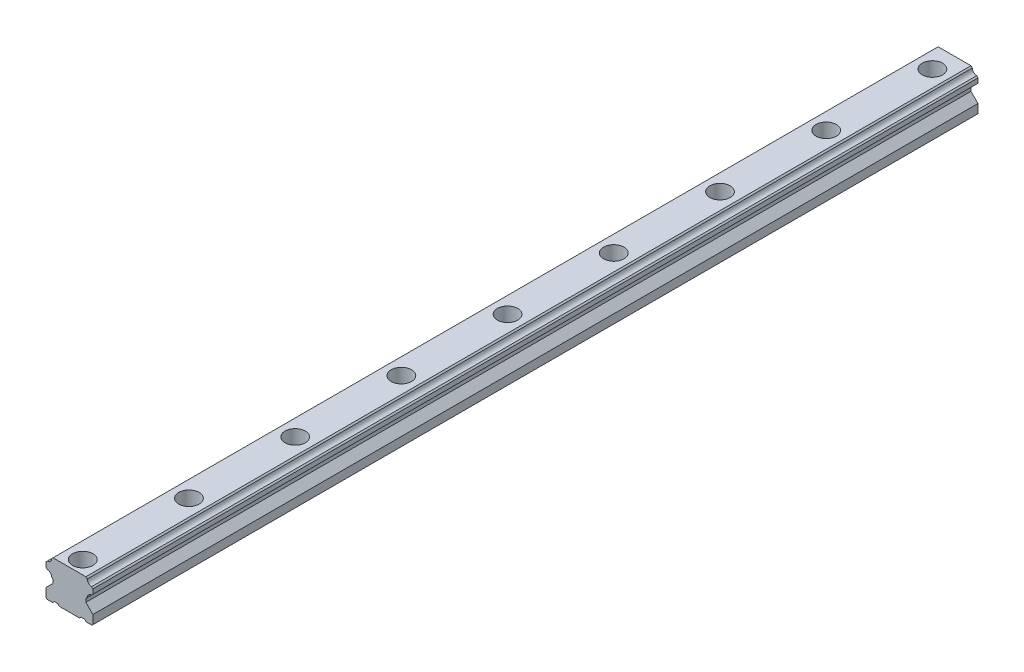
ISO-10303-21;
HEADER;
FILE_DESCRIPTION(('STEP AP214'),'2;1');
FILE_NAME('part.step','',(''),(''),'','','');
FILE_SCHEMA(('AUTOMOTIVE_DESIGN { 1 0 10303 214 1 1 1 1 }'));
ENDSEC;
DATA;
#1=APPLICATION_CONTEXT('core data for automotive mechanical design processes');
#2=APPLICATION_PROTOCOL_DEFINITION('international standard','automotive_design',2000,#1);
#3=PRODUCT_CONTEXT('',#1,'mechanical');
#4=PRODUCT('Part','Part','',(#3));
#5=PRODUCT_RELATED_PRODUCT_CATEGORY('part','',(#4));
#6=PRODUCT_DEFINITION_FORMATION('','',#4);
#7=PRODUCT_DEFINITION_CONTEXT('part definition',#1,'design');
#8=PRODUCT_DEFINITION('design','',#6,#7);
#9=PRODUCT_DEFINITION_SHAPE('','',#8);
#10=(LENGTH_UNIT() NAMED_UNIT(*) SI_UNIT(.MILLI.,.METRE.));
#11=(NAMED_UNIT(*) PLANE_ANGLE_UNIT() SI_UNIT($,.RADIAN.));
#12=(NAMED_UNIT(*) SI_UNIT($,.STERADIAN.) SOLID_ANGLE_UNIT());
#13=UNCERTAINTY_MEASURE_WITH_UNIT(LENGTH_MEASURE(1.E-05),#10,'distance_accuracy_value','');
#14=(GEOMETRIC_REPRESENTATION_CONTEXT(3) GLOBAL_UNCERTAINTY_ASSIGNED_CONTEXT((#13)) GLOBAL_UNIT_ASSIGNED_CONTEXT((#10,
#11,#12)) REPRESENTATION_CONTEXT('',''));
#15=CARTESIAN_POINT('',(0.,0.,0.));
#16=DIRECTION('',(0.,0.,1.));
#17=DIRECTION('',(1.,0.,0.));
#18=AXIS2_PLACEMENT_3D('',#15,#16,#17);
#19=CARTESIAN_POINT('',(18.6822655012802,21.9777940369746,1000.));
#20=DIRECTION('',(0.,-1.,0.));
#21=DIRECTION('',(0.,0.,-1.));
#22=AXIS2_PLACEMENT_3D('',#19,#20,#21);
#23=PLANE('',#22);
#24=CARTESIAN_POINT('',(0.132265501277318,21.9777940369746,144.999999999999));
#25=DIRECTION('',(0.,1.,0.));
#26=DIRECTION('',(0.,0.,1.));
#27=AXIS2_PLACEMENT_3D('',#24,#25,#26);
#28=CIRCLE('',#27,11.5);
#29=CARTESIAN_POINT('',(0.132265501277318,21.9777940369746,156.499999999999));
#30=VERTEX_POINT('',#29);
#31=EDGE_CURVE('E852',#30,#30,#28,.T.);
#32=ORIENTED_EDGE('',*,*,#31,.F.);
#33=EDGE_LOOP('',(#32));
#34=FACE_BOUND('',#33,.T.);
#35=CARTESIAN_POINT('',(0.132265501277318,21.9777940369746,264.999999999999));
#36=DIRECTION('',(0.,1.,0.));
#37=DIRECTION('',(0.,0.,1.));
#38=AXIS2_PLACEMENT_3D('',#35,#36,#37);
#39=CIRCLE('',#38,11.5);
#40=CARTESIAN_POINT('',(0.132265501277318,21.9777940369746,276.499999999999));
#41=VERTEX_POINT('',#40);
#42=EDGE_CURVE('E838',#41,#41,#39,.T.);
#43=ORIENTED_EDGE('',*,*,#42,.F.);
#44=EDGE_LOOP('',(#43));
#45=FACE_BOUND('',#44,.T.);
#46=CARTESIAN_POINT('',(0.132265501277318,21.9777940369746,504.999999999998));
#47=DIRECTION('',(0.,1.,0.));
#48=DIRECTION('',(0.,0.,1.));
#49=AXIS2_PLACEMENT_3D('',#46,#47,#48);
#50=CIRCLE('',#49,11.5);
#51=CARTESIAN_POINT('',(0.132265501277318,21.9777940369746,516.499999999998));
#52=VERTEX_POINT('',#51);
#53=EDGE_CURVE('E810',#52,#52,#50,.T.);
#54=ORIENTED_EDGE('',*,*,#53,.F.);
#55=EDGE_LOOP('',(#54));
#56=FACE_BOUND('',#55,.T.);
#57=CARTESIAN_POINT('',(0.132265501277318,21.9777940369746,624.999999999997));
#58=DIRECTION('',(0.,1.,0.));
#59=DIRECTION('',(0.,0.,1.));
#60=AXIS2_PLACEMENT_3D('',#57,#58,#59);
#61=CIRCLE('',#60,11.5);
#62=CARTESIAN_POINT('',(0.132265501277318,21.9777940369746,636.499999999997));
#63=VERTEX_POINT('',#62);
#64=EDGE_CURVE('E796',#63,#63,#61,.T.);
#65=ORIENTED_EDGE('',*,*,#64,.F.);
#66=EDGE_LOOP('',(#65));
#67=FACE_BOUND('',#66,.T.);
#68=CARTESIAN_POINT('',(0.132265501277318,21.9777940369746,744.999999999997));
#69=DIRECTION('',(0.,1.,0.));
#70=DIRECTION('',(0.,0.,1.));
#71=AXIS2_PLACEMENT_3D('',#68,#69,#70);
#72=CIRCLE('',#71,11.5);
#73=CARTESIAN_POINT('',(0.132265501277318,21.9777940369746,756.499999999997));
#74=VERTEX_POINT('',#73);
#75=EDGE_CURVE('E782',#74,#74,#72,.T.);
#76=ORIENTED_EDGE('',*,*,#75,.F.);
#77=EDGE_LOOP('',(#76));
#78=FACE_BOUND('',#77,.T.);
#79=CARTESIAN_POINT('',(0.132265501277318,21.9777940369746,864.999999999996));
#80=DIRECTION('',(0.,1.,0.));
#81=DIRECTION('',(0.,0.,1.));
#82=AXIS2_PLACEMENT_3D('',#79,#80,#81);
#83=CIRCLE('',#82,11.5);
#84=CARTESIAN_POINT('',(0.132265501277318,21.9777940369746,876.499999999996));
#85=VERTEX_POINT('',#84);
#86=EDGE_CURVE('E768',#85,#85,#83,.T.);
#87=ORIENTED_EDGE('',*,*,#86,.F.);
#88=EDGE_LOOP('',(#87));
#89=FACE_BOUND('',#88,.T.);
#90=CARTESIAN_POINT('',(0.132265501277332,21.9777940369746,984.999999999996));
#91=DIRECTION('',(0.,1.,0.));
#92=DIRECTION('',(0.,0.,1.));
#93=AXIS2_PLACEMENT_3D('',#90,#91,#92);
#94=CIRCLE('',#93,11.5);
#95=CARTESIAN_POINT('',(0.132265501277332,21.9777940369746,996.499999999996));
#96=VERTEX_POINT('',#95);
#97=EDGE_CURVE('E754',#96,#96,#94,.T.);
#98=ORIENTED_EDGE('',*,*,#97,.F.);
#99=EDGE_LOOP('',(#98));
#100=FACE_BOUND('',#99,.T.);
#101=CARTESIAN_POINT('',(0.132265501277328,21.9777940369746,25.));
#102=DIRECTION('',(0.,1.,0.));
#103=DIRECTION('',(0.,0.,1.));
#104=AXIS2_PLACEMENT_3D('',#101,#102,#103);
#105=CIRCLE('',#104,11.5);
#106=CARTESIAN_POINT('',(0.132265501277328,21.9777940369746,36.5));
#107=VERTEX_POINT('',#106);
#108=EDGE_CURVE('E740',#107,#107,#105,.T.);
#109=ORIENTED_EDGE('',*,*,#108,.F.);
#110=EDGE_LOOP('',(#109));
#111=FACE_BOUND('',#110,.T.);
#112=DIRECTION('',(-1.,0.,0.));
#113=VECTOR('',#112,1.);
#114=CARTESIAN_POINT('',(18.6822655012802,21.9777940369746,0.));
#115=LINE('',#114,#113);
#116=CARTESIAN_POINT('',(18.6822655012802,21.9777940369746,0.));
#117=VERTEX_POINT('',#116);
#118=CARTESIAN_POINT('',(-18.4177344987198,21.9777940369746,0.));
#119=VERTEX_POINT('',#118);
#120=EDGE_CURVE('E344',#117,#119,#115,.T.);
#121=ORIENTED_EDGE('',*,*,#120,.T.);
#122=DIRECTION('',(0.,0.,-1.));
#123=VECTOR('',#122,1.);
#124=CARTESIAN_POINT('',(-18.4177344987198,21.9777940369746,1000.));
#125=LINE('',#124,#123);
#126=CARTESIAN_POINT('',(-18.4177344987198,21.9777940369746,1000.));
#127=VERTEX_POINT('',#126);
#128=EDGE_CURVE('E433',#127,#119,#125,.T.);
#129=ORIENTED_EDGE('',*,*,#128,.F.);
#130=DIRECTION('',(-1.,0.,0.));
#131=VECTOR('',#130,1.);
#132=CARTESIAN_POINT('',(18.6822655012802,21.9777940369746,1000.));
#133=LINE('',#132,#131);
#134=CARTESIAN_POINT('',(18.6822655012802,21.9777940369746,1000.));
#135=VERTEX_POINT('',#134);
#136=EDGE_CURVE('E563',#135,#127,#133,.T.);
#137=ORIENTED_EDGE('',*,*,#136,.F.);
#138=DIRECTION('',(0.,0.,-1.));
#139=VECTOR('',#138,1.);
#140=CARTESIAN_POINT('',(18.6822655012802,21.9777940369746,1000.));
#141=LINE('',#140,#139);
#142=EDGE_CURVE('E437',#135,#117,#141,.T.);
#143=ORIENTED_EDGE('',*,*,#142,.T.);
#144=EDGE_LOOP('',(#121,#129,#137,#143));
#145=FACE_BOUND('',#144,.T.);
#146=CARTESIAN_POINT('',(0.132265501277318,21.9777940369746,384.999999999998));
#147=DIRECTION('',(0.,1.,0.));
#148=DIRECTION('',(0.,0.,1.));
#149=AXIS2_PLACEMENT_3D('',#146,#147,#148);
#150=CIRCLE('',#149,11.5);
#151=CARTESIAN_POINT('',(0.132265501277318,21.9777940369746,396.499999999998));
#152=VERTEX_POINT('',#151);
#153=EDGE_CURVE('E824',#152,#152,#150,.T.);
#154=ORIENTED_EDGE('',*,*,#153,.F.);
#155=EDGE_LOOP('',(#154));
#156=FACE_BOUND('',#155,.T.);
#157=ADVANCED_FACE('F45',(#34,#45,#56,#67,#78,#89,#100,#111,#145,#156),#23,.F.);
#158=CARTESIAN_POINT('',(-12.9915440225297,-20.2555392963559,1000.));
#159=DIRECTION('',(0.707106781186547,0.707106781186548,0.));
#160=DIRECTION('',(-0.707106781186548,0.707106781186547,0.));
#161=AXIS2_PLACEMENT_3D('',#158,#159,#160);
#162=PLANE('',#161);
#163=DIRECTION('',(0.707106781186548,-0.707106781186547,0.));
#164=VECTOR('',#163,1.);
#165=CARTESIAN_POINT('',(-12.9915440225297,-20.2555392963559,0.));
#166=LINE('',#165,#164);
#167=CARTESIAN_POINT('',(-12.9915440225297,-20.2555392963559,0.));
#168=VERTEX_POINT('',#167);
#169=CARTESIAN_POINT('',(-11.2248773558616,-22.022205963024,0.));
#170=VERTEX_POINT('',#169);
#171=EDGE_CURVE('E291',#168,#170,#166,.T.);
#172=ORIENTED_EDGE('',*,*,#171,.T.);
#173=DIRECTION('',(0.,0.,-1.));
#174=VECTOR('',#173,1.);
#175=CARTESIAN_POINT('',(-11.2248773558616,-22.022205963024,1000.));
#176=LINE('',#175,#174);
#177=CARTESIAN_POINT('',(-11.2248773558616,-22.022205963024,1000.));
#178=VERTEX_POINT('',#177);
#179=EDGE_CURVE('E12',#178,#170,#176,.T.);
#180=ORIENTED_EDGE('',*,*,#179,.F.);
#181=DIRECTION('',(0.707106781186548,-0.707106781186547,0.));
#182=VECTOR('',#181,1.);
#183=CARTESIAN_POINT('',(-12.9915440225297,-20.2555392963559,1000.));
#184=LINE('',#183,#182);
#185=CARTESIAN_POINT('',(-12.9915440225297,-20.2555392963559,1000.));
#186=VERTEX_POINT('',#185);
#187=EDGE_CURVE('E386',#186,#178,#184,.T.);
#188=ORIENTED_EDGE('',*,*,#187,.F.);
#189=DIRECTION('',(0.,0.,-1.));
#190=VECTOR('',#189,1.);
#191=CARTESIAN_POINT('',(-12.9915440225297,-20.2555392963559,1000.));
#192=LINE('',#191,#190);
#193=EDGE_CURVE('E287',#186,#168,#192,.T.);
#194=ORIENTED_EDGE('',*,*,#193,.T.);
#195=EDGE_LOOP('',(#172,#180,#188,#194));
#196=FACE_BOUND('',#195,.T.);
#197=ADVANCED_FACE('F47',(#196),#162,.F.);
#198=CARTESIAN_POINT('',(-11.2248773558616,-22.022205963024,1000.));
#199=DIRECTION('',(0.,1.,0.));
#200=DIRECTION('',(0.,0.,1.));
#201=AXIS2_PLACEMENT_3D('',#198,#199,#200);
#202=PLANE('',#201);
#203=CARTESIAN_POINT('',(0.132265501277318,-22.0222059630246,144.999999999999));
#204=DIRECTION('',(0.,1.,0.));
#205=DIRECTION('',(0.,0.,1.));
#206=AXIS2_PLACEMENT_3D('',#203,#204,#205);
#207=CIRCLE('',#206,7.99999999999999);
#208=CARTESIAN_POINT('',(0.132265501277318,-22.0222059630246,152.999999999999));
#209=VERTEX_POINT('',#208);
#210=EDGE_CURVE('E692',#209,#209,#207,.T.);
#211=ORIENTED_EDGE('',*,*,#210,.T.);
#212=EDGE_LOOP('',(#211));
#213=FACE_BOUND('',#212,.T.);
#214=CARTESIAN_POINT('',(0.132265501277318,-22.0222059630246,264.999999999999));
#215=DIRECTION('',(0.,1.,0.));
#216=DIRECTION('',(0.,0.,1.));
#217=AXIS2_PLACEMENT_3D('',#214,#215,#216);
#218=CIRCLE('',#217,7.99999999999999);
#219=CARTESIAN_POINT('',(0.132265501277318,-22.0222059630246,272.999999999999));
#220=VERTEX_POINT('',#219);
#221=EDGE_CURVE('E696',#220,#220,#218,.T.);
#222=ORIENTED_EDGE('',*,*,#221,.T.);
#223=EDGE_LOOP('',(#222));
#224=FACE_BOUND('',#223,.T.);
#225=CARTESIAN_POINT('',(0.132265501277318,-22.0222059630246,384.999999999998));
#226=DIRECTION('',(0.,1.,0.));
#227=DIRECTION('',(0.,0.,1.));
#228=AXIS2_PLACEMENT_3D('',#225,#226,#227);
#229=CIRCLE('',#228,7.99999999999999);
#230=CARTESIAN_POINT('',(0.132265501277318,-22.0222059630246,392.999999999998));
#231=VERTEX_POINT('',#230);
#232=EDGE_CURVE('E700',#231,#231,#229,.T.);
#233=ORIENTED_EDGE('',*,*,#232,.T.);
#234=EDGE_LOOP('',(#233));
#235=FACE_BOUND('',#234,.T.);
#236=CARTESIAN_POINT('',(0.132265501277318,-22.0222059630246,504.999999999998));
#237=DIRECTION('',(0.,1.,0.));
#238=DIRECTION('',(0.,0.,1.));
#239=AXIS2_PLACEMENT_3D('',#236,#237,#238);
#240=CIRCLE('',#239,7.99999999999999);
#241=CARTESIAN_POINT('',(0.132265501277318,-22.0222059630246,512.999999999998));
#242=VERTEX_POINT('',#241);
#243=EDGE_CURVE('E704',#242,#242,#240,.T.);
#244=ORIENTED_EDGE('',*,*,#243,.T.);
#245=EDGE_LOOP('',(#244));
#246=FACE_BOUND('',#245,.T.);
#247=CARTESIAN_POINT('',(0.132265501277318,-22.0222059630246,624.999999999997));
#248=DIRECTION('',(0.,1.,0.));
#249=DIRECTION('',(0.,0.,1.));
#250=AXIS2_PLACEMENT_3D('',#247,#248,#249);
#251=CIRCLE('',#250,7.99999999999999);
#252=CARTESIAN_POINT('',(0.132265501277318,-22.0222059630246,632.999999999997));
#253=VERTEX_POINT('',#252);
#254=EDGE_CURVE('E708',#253,#253,#251,.T.);
#255=ORIENTED_EDGE('',*,*,#254,.T.);
#256=EDGE_LOOP('',(#255));
#257=FACE_BOUND('',#256,.T.);
#258=CARTESIAN_POINT('',(0.132265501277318,-22.0222059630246,744.999999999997));
#259=DIRECTION('',(0.,1.,0.));
#260=DIRECTION('',(0.,0.,1.));
#261=AXIS2_PLACEMENT_3D('',#258,#259,#260);
#262=CIRCLE('',#261,7.99999999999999);
#263=CARTESIAN_POINT('',(0.132265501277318,-22.0222059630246,752.999999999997));
#264=VERTEX_POINT('',#263);
#265=EDGE_CURVE('E712',#264,#264,#262,.T.);
#266=ORIENTED_EDGE('',*,*,#265,.T.);
#267=EDGE_LOOP('',(#266));
#268=FACE_BOUND('',#267,.T.);
#269=CARTESIAN_POINT('',(0.132265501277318,-22.0222059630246,864.999999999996));
#270=DIRECTION('',(0.,1.,0.));
#271=DIRECTION('',(0.,0.,1.));
#272=AXIS2_PLACEMENT_3D('',#269,#270,#271);
#273=CIRCLE('',#272,7.99999999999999);
#274=CARTESIAN_POINT('',(0.132265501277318,-22.0222059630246,872.999999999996));
#275=VERTEX_POINT('',#274);
#276=EDGE_CURVE('E716',#275,#275,#273,.T.);
#277=ORIENTED_EDGE('',*,*,#276,.T.);
#278=EDGE_LOOP('',(#277));
#279=FACE_BOUND('',#278,.T.);
#280=CARTESIAN_POINT('',(0.132265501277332,-22.0222059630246,984.999999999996));
#281=DIRECTION('',(0.,1.,0.));
#282=DIRECTION('',(0.,0.,1.));
#283=AXIS2_PLACEMENT_3D('',#280,#281,#282);
#284=CIRCLE('',#283,7.99999999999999);
#285=CARTESIAN_POINT('',(0.132265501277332,-22.0222059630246,992.999999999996));
#286=VERTEX_POINT('',#285);
#287=EDGE_CURVE('E720',#286,#286,#284,.T.);
#288=ORIENTED_EDGE('',*,*,#287,.T.);
#289=EDGE_LOOP('',(#288));
#290=FACE_BOUND('',#289,.T.);
#291=CARTESIAN_POINT('',(0.132265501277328,-22.0222059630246,25.));
#292=DIRECTION('',(0.,1.,0.));
#293=DIRECTION('',(0.,0.,1.));
#294=AXIS2_PLACEMENT_3D('',#291,#292,#293);
#295=CIRCLE('',#294,7.99999999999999);
#296=CARTESIAN_POINT('',(0.132265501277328,-22.0222059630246,33.));
#297=VERTEX_POINT('',#296);
#298=EDGE_CURVE('E296',#297,#297,#295,.T.);
#299=ORIENTED_EDGE('',*,*,#298,.T.);
#300=EDGE_LOOP('',(#299));
#301=FACE_BOUND('',#300,.T.);
#302=DIRECTION('',(1.,0.,0.));
#303=VECTOR('',#302,1.);
#304=CARTESIAN_POINT('',(-11.2248773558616,-22.022205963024,0.));
#305=LINE('',#304,#303);
#306=CARTESIAN_POINT('',(11.4894083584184,-22.022205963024,0.));
#307=VERTEX_POINT('',#306);
#308=EDGE_CURVE('E295',#170,#307,#305,.T.);
#309=ORIENTED_EDGE('',*,*,#308,.T.);
#310=DIRECTION('',(0.,0.,-1.));
#311=VECTOR('',#310,1.);
#312=CARTESIAN_POINT('',(11.4894083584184,-22.022205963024,1000.));
#313=LINE('',#312,#311);
#314=CARTESIAN_POINT('',(11.4894083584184,-22.022205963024,1000.));
#315=VERTEX_POINT('',#314);
#316=EDGE_CURVE('E55',#315,#307,#313,.T.);
#317=ORIENTED_EDGE('',*,*,#316,.F.);
#318=DIRECTION('',(1.,0.,0.));
#319=VECTOR('',#318,1.);
#320=CARTESIAN_POINT('',(-11.2248773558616,-22.022205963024,1000.));
#321=LINE('',#320,#319);
#322=EDGE_CURVE('E178',#178,#315,#321,.T.);
#323=ORIENTED_EDGE('',*,*,#322,.F.);
#324=ORIENTED_EDGE('',*,*,#179,.T.);
#325=EDGE_LOOP('',(#309,#317,#323,#324));
#326=FACE_BOUND('',#325,.T.);
#327=ADVANCED_FACE('F625',(#213,#224,#235,#246,#257,#268,#279,#290,#301,#326),#202,.F.);
#328=CARTESIAN_POINT('',(11.4894083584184,-22.022205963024,1000.));
#329=DIRECTION('',(-0.707106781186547,0.707106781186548,0.));
#330=DIRECTION('',(-0.707106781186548,-0.707106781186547,0.));
#331=AXIS2_PLACEMENT_3D('',#328,#329,#330);
#332=PLANE('',#331);
#333=DIRECTION('',(0.707106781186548,0.707106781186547,0.));
#334=VECTOR('',#333,1.);
#335=CARTESIAN_POINT('',(11.4894083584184,-22.022205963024,0.));
#336=LINE('',#335,#334);
#337=CARTESIAN_POINT('',(13.2560750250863,-20.2555392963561,0.));
#338=VERTEX_POINT('',#337);
#339=EDGE_CURVE('E299',#307,#338,#336,.T.);
#340=ORIENTED_EDGE('',*,*,#339,.T.);
#341=DIRECTION('',(0.,0.,-1.));
#342=VECTOR('',#341,1.);
#343=CARTESIAN_POINT('',(13.2560750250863,-20.2555392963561,1000.));
#344=LINE('',#343,#342);
#345=CARTESIAN_POINT('',(13.2560750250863,-20.2555392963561,1000.));
#346=VERTEX_POINT('',#345);
#347=EDGE_CURVE('E493',#346,#338,#344,.T.);
#348=ORIENTED_EDGE('',*,*,#347,.F.);
#349=DIRECTION('',(0.707106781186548,0.707106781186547,0.));
#350=VECTOR('',#349,1.);
#351=CARTESIAN_POINT('',(11.4894083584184,-22.022205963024,1000.));
#352=LINE('',#351,#350);
#353=EDGE_CURVE('E503',#315,#346,#352,.T.);
#354=ORIENTED_EDGE('',*,*,#353,.F.);
#355=ORIENTED_EDGE('',*,*,#316,.T.);
#356=EDGE_LOOP('',(#340,#348,#354,#355));
#357=FACE_BOUND('',#356,.T.);
#358=ADVANCED_FACE('F501',(#357),#332,.F.);
#359=CARTESIAN_POINT('',(13.2560750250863,-20.2555392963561,1000.));
#360=DIRECTION('',(0.,1.,0.));
#361=DIRECTION('',(0.,0.,1.));
#362=AXIS2_PLACEMENT_3D('',#359,#360,#361);
#363=PLANE('',#362);
#364=DIRECTION('',(1.,0.,0.));
#365=VECTOR('',#364,1.);
#366=CARTESIAN_POINT('',(13.2560750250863,-20.2555392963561,0.));
#367=LINE('',#366,#365);
#368=CARTESIAN_POINT('',(17.2941702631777,-20.2555392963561,0.));
#369=VERTEX_POINT('',#368);
#370=EDGE_CURVE('E302',#338,#369,#367,.T.);
#371=ORIENTED_EDGE('',*,*,#370,.T.);
#372=DIRECTION('',(0.,0.,-1.));
#373=VECTOR('',#372,1.);
#374=CARTESIAN_POINT('',(17.2941702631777,-20.2555392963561,1000.));
#375=LINE('',#374,#373);
#376=CARTESIAN_POINT('',(17.2941702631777,-20.2555392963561,1000.));
#377=VERTEX_POINT('',#376);
#378=EDGE_CURVE('E489',#377,#369,#375,.T.);
#379=ORIENTED_EDGE('',*,*,#378,.F.);
#380=DIRECTION('',(1.,0.,0.));
#381=VECTOR('',#380,1.);
#382=CARTESIAN_POINT('',(13.2560750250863,-20.2555392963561,1000.));
#383=LINE('',#382,#381);
#384=EDGE_CURVE('E522',#346,#377,#383,.T.);
#385=ORIENTED_EDGE('',*,*,#384,.F.);
#386=ORIENTED_EDGE('',*,*,#347,.T.);
#387=EDGE_LOOP('',(#371,#379,#385,#386));
#388=FACE_BOUND('',#387,.T.);
#389=ADVANCED_FACE('F512',(#388),#363,.F.);
#390=CARTESIAN_POINT('',(17.2941702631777,-20.2555392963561,1000.));
#391=DIRECTION('',(0.707106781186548,0.707106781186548,0.));
#392=DIRECTION('',(-0.707106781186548,0.707106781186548,0.));
#393=AXIS2_PLACEMENT_3D('',#390,#391,#392);
#394=PLANE('',#393);
#395=DIRECTION('',(0.707106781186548,-0.707106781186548,0.));
#396=VECTOR('',#395,1.);
#397=CARTESIAN_POINT('',(17.2941702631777,-20.2555392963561,0.));
#398=LINE('',#397,#396);
#399=CARTESIAN_POINT('',(19.0608369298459,-22.0222059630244,0.));
#400=VERTEX_POINT('',#399);
#401=EDGE_CURVE('E305',#369,#400,#398,.T.);
#402=ORIENTED_EDGE('',*,*,#401,.T.);
#403=DIRECTION('',(0.,0.,-1.));
#404=VECTOR('',#403,1.);
#405=CARTESIAN_POINT('',(19.0608369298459,-22.0222059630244,1000.));
#406=LINE('',#405,#404);
#407=CARTESIAN_POINT('',(19.0608369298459,-22.0222059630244,1000.));
#408=VERTEX_POINT('',#407);
#409=EDGE_CURVE('E485',#408,#400,#406,.T.);
#410=ORIENTED_EDGE('',*,*,#409,.F.);
#411=DIRECTION('',(0.707106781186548,-0.707106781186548,0.));
#412=VECTOR('',#411,1.);
#413=CARTESIAN_POINT('',(17.2941702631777,-20.2555392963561,1000.));
#414=LINE('',#413,#412);
#415=EDGE_CURVE('E518',#377,#408,#414,.T.);
#416=ORIENTED_EDGE('',*,*,#415,.F.);
#417=ORIENTED_EDGE('',*,*,#378,.T.);
#418=EDGE_LOOP('',(#402,#410,#416,#417));
#419=FACE_BOUND('',#418,.T.);
#420=ADVANCED_FACE('F516',(#419),#394,.F.);
#421=CARTESIAN_POINT('',(19.0608369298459,-22.0222059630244,1000.));
#422=DIRECTION('',(0.,1.,0.));
#423=DIRECTION('',(0.,0.,1.));
#424=AXIS2_PLACEMENT_3D('',#421,#422,#423);
#425=PLANE('',#424);
#426=DIRECTION('',(1.,0.,0.));
#427=VECTOR('',#426,1.);
#428=CARTESIAN_POINT('',(19.0608369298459,-22.0222059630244,0.));
#429=LINE('',#428,#427);
#430=CARTESIAN_POINT('',(25.6322655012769,-22.0222059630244,0.));
#431=VERTEX_POINT('',#430);
#432=EDGE_CURVE('E308',#400,#431,#429,.T.);
#433=ORIENTED_EDGE('',*,*,#432,.T.);
#434=DIRECTION('',(0.,0.,-1.));
#435=VECTOR('',#434,1.);
#436=CARTESIAN_POINT('',(25.6322655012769,-22.0222059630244,1000.));
#437=LINE('',#436,#435);
#438=CARTESIAN_POINT('',(25.6322655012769,-22.0222059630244,1000.));
#439=VERTEX_POINT('',#438);
#440=EDGE_CURVE('E481',#439,#431,#437,.T.);
#441=ORIENTED_EDGE('',*,*,#440,.F.);
#442=DIRECTION('',(1.,0.,0.));
#443=VECTOR('',#442,1.);
#444=CARTESIAN_POINT('',(19.0608369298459,-22.0222059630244,1000.));
#445=LINE('',#444,#443);
#446=EDGE_CURVE('E521',#408,#439,#445,.T.);
#447=ORIENTED_EDGE('',*,*,#446,.F.);
#448=ORIENTED_EDGE('',*,*,#409,.T.);
#449=EDGE_LOOP('',(#433,#441,#447,#448));
#450=FACE_BOUND('',#449,.T.);
#451=ADVANCED_FACE('F675',(#450),#425,.F.);
#452=CARTESIAN_POINT('',(25.6322655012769,-22.0222059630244,1000.));
#453=DIRECTION('',(-0.707106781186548,0.707106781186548,0.));
#454=DIRECTION('',(-0.707106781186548,-0.707106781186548,0.));
#455=AXIS2_PLACEMENT_3D('',#452,#453,#454);
#456=PLANE('',#455);
#457=DIRECTION('',(0.707106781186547,0.707106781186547,0.));
#458=VECTOR('',#457,1.);
#459=CARTESIAN_POINT('',(25.6322655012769,-22.0222059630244,0.));
#460=LINE('',#459,#458);
#461=CARTESIAN_POINT('',(26.6322655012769,-21.0222059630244,0.));
#462=VERTEX_POINT('',#461);
#463=EDGE_CURVE('E311',#431,#462,#460,.T.);
#464=ORIENTED_EDGE('',*,*,#463,.T.);
#465=DIRECTION('',(0.,0.,-1.));
#466=VECTOR('',#465,1.);
#467=CARTESIAN_POINT('',(26.6322655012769,-21.0222059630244,1000.));
#468=LINE('',#467,#466);
#469=CARTESIAN_POINT('',(26.6322655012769,-21.0222059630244,1000.));
#470=VERTEX_POINT('',#469);
#471=EDGE_CURVE('E477',#470,#462,#468,.T.);
#472=ORIENTED_EDGE('',*,*,#471,.F.);
#473=DIRECTION('',(0.707106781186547,0.707106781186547,0.));
#474=VECTOR('',#473,1.);
#475=CARTESIAN_POINT('',(25.6322655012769,-22.0222059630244,1000.));
#476=LINE('',#475,#474);
#477=EDGE_CURVE('E526',#439,#470,#476,.T.);
#478=ORIENTED_EDGE('',*,*,#477,.F.);
#479=ORIENTED_EDGE('',*,*,#440,.T.);
#480=EDGE_LOOP('',(#464,#472,#478,#479));
#481=FACE_BOUND('',#480,.T.);
#482=ADVANCED_FACE('F671',(#481),#456,.F.);
#483=CARTESIAN_POINT('',(26.6322655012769,-21.0222059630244,1000.));
#484=DIRECTION('',(-1.,0.,0.));
#485=DIRECTION('',(0.,0.,1.));
#486=AXIS2_PLACEMENT_3D('',#483,#484,#485);
#487=PLANE('',#486);
#488=DIRECTION('',(0.,1.,0.));
#489=VECTOR('',#488,1.);
#490=CARTESIAN_POINT('',(26.6322655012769,-21.0222059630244,0.));
#491=LINE('',#490,#489);
#492=CARTESIAN_POINT('',(26.6322655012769,-11.0222059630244,0.));
#493=VERTEX_POINT('',#492);
#494=EDGE_CURVE('E314',#462,#493,#491,.T.);
#495=ORIENTED_EDGE('',*,*,#494,.T.);
#496=DIRECTION('',(0.,0.,-1.));
#497=VECTOR('',#496,1.);
#498=CARTESIAN_POINT('',(26.6322655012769,-11.0222059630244,1000.));
#499=LINE('',#498,#497);
#500=CARTESIAN_POINT('',(26.6322655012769,-11.0222059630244,1000.));
#501=VERTEX_POINT('',#500);
#502=EDGE_CURVE('E473',#501,#493,#499,.T.);
#503=ORIENTED_EDGE('',*,*,#502,.F.);
#504=DIRECTION('',(0.,1.,0.));
#505=VECTOR('',#504,1.);
#506=CARTESIAN_POINT('',(26.6322655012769,-21.0222059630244,1000.));
#507=LINE('',#506,#505);
#508=EDGE_CURVE('E533',#470,#501,#507,.T.);
#509=ORIENTED_EDGE('',*,*,#508,.F.);
#510=ORIENTED_EDGE('',*,*,#471,.T.);
#511=EDGE_LOOP('',(#495,#503,#509,#510));
#512=FACE_BOUND('',#511,.T.);
#513=ADVANCED_FACE('F667',(#512),#487,.F.);
#514=CARTESIAN_POINT('',(26.6322655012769,-11.0222059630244,1000.));
#515=DIRECTION('',(-0.707106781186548,-0.707106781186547,0.));
#516=DIRECTION('',(0.707106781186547,-0.707106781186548,0.));
#517=AXIS2_PLACEMENT_3D('',#514,#515,#516);
#518=PLANE('',#517);
#519=DIRECTION('',(-0.707106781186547,0.707106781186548,0.));
#520=VECTOR('',#519,1.);
#521=CARTESIAN_POINT('',(26.6322655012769,-11.0222059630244,0.));
#522=LINE('',#521,#520);
#523=CARTESIAN_POINT('',(18.6822655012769,-3.07220596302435,0.));
#524=VERTEX_POINT('',#523);
#525=EDGE_CURVE('E317',#493,#524,#522,.T.);
#526=ORIENTED_EDGE('',*,*,#525,.T.);
#527=DIRECTION('',(0.,0.,-1.));
#528=VECTOR('',#527,1.);
#529=CARTESIAN_POINT('',(18.6822655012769,-3.07220596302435,1000.));
#530=LINE('',#529,#528);
#531=CARTESIAN_POINT('',(18.6822655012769,-3.07220596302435,1000.));
#532=VERTEX_POINT('',#531);
#533=EDGE_CURVE('E469',#532,#524,#530,.T.);
#534=ORIENTED_EDGE('',*,*,#533,.F.);
#535=DIRECTION('',(-0.707106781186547,0.707106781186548,0.));
#536=VECTOR('',#535,1.);
#537=CARTESIAN_POINT('',(26.6322655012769,-11.0222059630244,1000.));
#538=LINE('',#537,#536);
#539=EDGE_CURVE('E536',#501,#532,#538,.T.);
#540=ORIENTED_EDGE('',*,*,#539,.F.);
#541=ORIENTED_EDGE('',*,*,#502,.T.);
#542=EDGE_LOOP('',(#526,#534,#540,#541));
#543=FACE_BOUND('',#542,.T.);
#544=ADVANCED_FACE('F663',(#543),#518,.F.);
#545=CARTESIAN_POINT('',(18.6822655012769,-3.07220596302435,1000.));
#546=DIRECTION('',(-1.,0.,0.));
#547=DIRECTION('',(0.,0.,1.));
#548=AXIS2_PLACEMENT_3D('',#545,#546,#547);
#549=PLANE('',#548);
#550=DIRECTION('',(0.,1.,0.));
#551=VECTOR('',#550,1.);
#552=CARTESIAN_POINT('',(18.6822655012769,-3.07220596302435,0.));
#553=LINE('',#552,#551);
#554=CARTESIAN_POINT('',(18.6822655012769,0.827794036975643,0.));
#555=VERTEX_POINT('',#554);
#556=EDGE_CURVE('E320',#524,#555,#553,.T.);
#557=ORIENTED_EDGE('',*,*,#556,.T.);
#558=DIRECTION('',(0.,0.,-1.));
#559=VECTOR('',#558,1.);
#560=CARTESIAN_POINT('',(18.6822655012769,0.827794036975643,1000.));
#561=LINE('',#560,#559);
#562=CARTESIAN_POINT('',(18.6822655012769,0.827794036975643,1000.));
#563=VERTEX_POINT('',#562);
#564=EDGE_CURVE('E465',#563,#555,#561,.T.);
#565=ORIENTED_EDGE('',*,*,#564,.F.);
#566=DIRECTION('',(0.,1.,0.));
#567=VECTOR('',#566,1.);
#568=CARTESIAN_POINT('',(18.6822655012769,-3.07220596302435,1000.));
#569=LINE('',#568,#567);
#570=EDGE_CURVE('E539',#532,#563,#569,.T.);
#571=ORIENTED_EDGE('',*,*,#570,.F.);
#572=ORIENTED_EDGE('',*,*,#533,.T.);
#573=EDGE_LOOP('',(#557,#565,#571,#572));
#574=FACE_BOUND('',#573,.T.);
#575=ADVANCED_FACE('F659',(#574),#549,.F.);
#576=CARTESIAN_POINT('',(18.6822655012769,0.827794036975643,1000.));
#577=DIRECTION('',(-0.707106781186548,0.707106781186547,0.));
#578=DIRECTION('',(-0.707106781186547,-0.707106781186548,0.));
#579=AXIS2_PLACEMENT_3D('',#576,#577,#578);
#580=PLANE('',#579);
#581=DIRECTION('',(0.707106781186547,0.707106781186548,0.));
#582=VECTOR('',#581,1.);
#583=CARTESIAN_POINT('',(18.6822655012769,0.827794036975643,0.));
#584=LINE('',#583,#582);
#585=CARTESIAN_POINT('',(20.1784174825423,2.32394601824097,0.));
#586=VERTEX_POINT('',#585);
#587=EDGE_CURVE('E323',#555,#586,#584,.T.);
#588=ORIENTED_EDGE('',*,*,#587,.T.);
#589=DIRECTION('',(0.,0.,-1.));
#590=VECTOR('',#589,1.);
#591=CARTESIAN_POINT('',(20.1784174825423,2.32394601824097,1000.));
#592=LINE('',#591,#590);
#593=CARTESIAN_POINT('',(20.1784174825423,2.32394601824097,1000.));
#594=VERTEX_POINT('',#593);
#595=EDGE_CURVE('E461',#594,#586,#592,.T.);
#596=ORIENTED_EDGE('',*,*,#595,.F.);
#597=DIRECTION('',(0.707106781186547,0.707106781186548,0.));
#598=VECTOR('',#597,1.);
#599=CARTESIAN_POINT('',(18.6822655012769,0.827794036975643,1000.));
#600=LINE('',#599,#598);
#601=EDGE_CURVE('E542',#563,#594,#600,.T.);
#602=ORIENTED_EDGE('',*,*,#601,.F.);
#603=ORIENTED_EDGE('',*,*,#564,.T.);
#604=EDGE_LOOP('',(#588,#596,#602,#603));
#605=FACE_BOUND('',#604,.T.);
#606=ADVANCED_FACE('F655',(#605),#580,.F.);
#607=CARTESIAN_POINT('',(25.4680149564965,1.99204458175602,1000.));
#608=DIRECTION('',(0.,0.,-1.));
#609=DIRECTION('',(-1.,0.,0.));
#610=AXIS2_PLACEMENT_3D('',#607,#608,#609);
#611=CYLINDRICAL_SURFACE('',#610,5.30000000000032);
#612=CARTESIAN_POINT('',(25.4680149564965,1.99204458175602,0.));
#613=DIRECTION('',(0.,0.,-1.));
#614=DIRECTION('',(1.,0.,0.));
#615=AXIS2_PLACEMENT_3D('',#612,#613,#614);
#616=CIRCLE('',#615,5.30000000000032);
#617=CARTESIAN_POINT('',(25.1361135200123,7.28164205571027,0.));
#618=VERTEX_POINT('',#617);
#619=EDGE_CURVE('E326',#586,#618,#616,.T.);
#620=ORIENTED_EDGE('',*,*,#619,.T.);
#621=DIRECTION('',(0.,0.,-1.));
#622=VECTOR('',#621,1.);
#623=CARTESIAN_POINT('',(25.1361135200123,7.28164205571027,1000.));
#624=LINE('',#623,#622);
#625=CARTESIAN_POINT('',(25.1361135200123,7.28164205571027,1000.));
#626=VERTEX_POINT('',#625);
#627=EDGE_CURVE('E457',#626,#618,#624,.T.);
#628=ORIENTED_EDGE('',*,*,#627,.F.);
#629=CARTESIAN_POINT('',(25.4680149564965,1.99204458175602,1000.));
#630=DIRECTION('',(0.,0.,-1.));
#631=DIRECTION('',(1.,0.,0.));
#632=AXIS2_PLACEMENT_3D('',#629,#630,#631);
#633=CIRCLE('',#632,5.30000000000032);
#634=EDGE_CURVE('E545',#594,#626,#633,.T.);
#635=ORIENTED_EDGE('',*,*,#634,.F.);
#636=ORIENTED_EDGE('',*,*,#595,.T.);
#637=EDGE_LOOP('',(#620,#628,#635,#636));
#638=FACE_BOUND('',#637,.T.);
#639=ADVANCED_FACE('F651',(#638),#611,.F.);
#640=CARTESIAN_POINT('',(25.1361135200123,7.28164205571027,1000.));
#641=DIRECTION('',(-0.707106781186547,0.707106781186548,0.));
#642=DIRECTION('',(-0.707106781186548,-0.707106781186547,0.));
#643=AXIS2_PLACEMENT_3D('',#640,#641,#642);
#644=PLANE('',#643);
#645=DIRECTION('',(0.707106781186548,0.707106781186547,0.));
#646=VECTOR('',#645,1.);
#647=CARTESIAN_POINT('',(25.1361135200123,7.28164205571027,0.));
#648=LINE('',#647,#646);
#649=CARTESIAN_POINT('',(26.6322655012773,8.77779403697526,0.));
#650=VERTEX_POINT('',#649);
#651=EDGE_CURVE('E329',#618,#650,#648,.T.);
#652=ORIENTED_EDGE('',*,*,#651,.T.);
#653=DIRECTION('',(0.,0.,-1.));
#654=VECTOR('',#653,1.);
#655=CARTESIAN_POINT('',(26.6322655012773,8.77779403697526,1000.));
#656=LINE('',#655,#654);
#657=CARTESIAN_POINT('',(26.6322655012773,8.77779403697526,1000.));
#658=VERTEX_POINT('',#657);
#659=EDGE_CURVE('E453',#658,#650,#656,.T.);
#660=ORIENTED_EDGE('',*,*,#659,.F.);
#661=DIRECTION('',(0.707106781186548,0.707106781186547,0.));
#662=VECTOR('',#661,1.);
#663=CARTESIAN_POINT('',(25.1361135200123,7.28164205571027,1000.));
#664=LINE('',#663,#662);
#665=EDGE_CURVE('E548',#626,#658,#664,.T.);
#666=ORIENTED_EDGE('',*,*,#665,.F.);
#667=ORIENTED_EDGE('',*,*,#627,.T.);
#668=EDGE_LOOP('',(#652,#660,#666,#667));
#669=FACE_BOUND('',#668,.T.);
#670=ADVANCED_FACE('F647',(#669),#644,.F.);
#671=CARTESIAN_POINT('',(26.6322655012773,8.77779403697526,1000.));
#672=DIRECTION('',(-1.,0.,0.));
#673=DIRECTION('',(0.,0.,1.));
#674=AXIS2_PLACEMENT_3D('',#671,#672,#673);
#675=PLANE('',#674);
#676=DIRECTION('',(0.,1.,0.));
#677=VECTOR('',#676,1.);
#678=CARTESIAN_POINT('',(26.6322655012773,8.77779403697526,0.));
#679=LINE('',#678,#677);
#680=CARTESIAN_POINT('',(26.6322655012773,14.0277940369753,0.));
#681=VERTEX_POINT('',#680);
#682=EDGE_CURVE('E332',#650,#681,#679,.T.);
#683=ORIENTED_EDGE('',*,*,#682,.T.);
#684=DIRECTION('',(0.,0.,-1.));
#685=VECTOR('',#684,1.);
#686=CARTESIAN_POINT('',(26.6322655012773,14.0277940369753,1000.));
#687=LINE('',#686,#685);
#688=CARTESIAN_POINT('',(26.6322655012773,14.0277940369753,1000.));
#689=VERTEX_POINT('',#688);
#690=EDGE_CURVE('E449',#689,#681,#687,.T.);
#691=ORIENTED_EDGE('',*,*,#690,.F.);
#692=DIRECTION('',(0.,1.,0.));
#693=VECTOR('',#692,1.);
#694=CARTESIAN_POINT('',(26.6322655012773,8.77779403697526,1000.));
#695=LINE('',#694,#693);
#696=EDGE_CURVE('E551',#658,#689,#695,.T.);
#697=ORIENTED_EDGE('',*,*,#696,.F.);
#698=ORIENTED_EDGE('',*,*,#659,.T.);
#699=EDGE_LOOP('',(#683,#691,#697,#698));
#700=FACE_BOUND('',#699,.T.);
#701=ADVANCED_FACE('F643',(#700),#675,.F.);
#702=CARTESIAN_POINT('',(26.6322655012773,14.0277940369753,1000.));
#703=DIRECTION('',(-0.707106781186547,-0.707106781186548,0.));
#704=DIRECTION('',(0.707106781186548,-0.707106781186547,0.));
#705=AXIS2_PLACEMENT_3D('',#702,#703,#704);
#706=PLANE('',#705);
#707=DIRECTION('',(-0.707106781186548,0.707106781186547,0.));
#708=VECTOR('',#707,1.);
#709=CARTESIAN_POINT('',(26.6322655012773,14.0277940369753,0.));
#710=LINE('',#709,#708);
#711=CARTESIAN_POINT('',(25.136113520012,15.5239460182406,0.));
#712=VERTEX_POINT('',#711);
#713=EDGE_CURVE('E335',#681,#712,#710,.T.);
#714=ORIENTED_EDGE('',*,*,#713,.T.);
#715=DIRECTION('',(0.,0.,-1.));
#716=VECTOR('',#715,1.);
#717=CARTESIAN_POINT('',(25.136113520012,15.5239460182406,1000.));
#718=LINE('',#717,#716);
#719=CARTESIAN_POINT('',(25.136113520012,15.5239460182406,1000.));
#720=VERTEX_POINT('',#719);
#721=EDGE_CURVE('E445',#720,#712,#718,.T.);
#722=ORIENTED_EDGE('',*,*,#721,.F.);
#723=DIRECTION('',(-0.707106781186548,0.707106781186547,0.));
#724=VECTOR('',#723,1.);
#725=CARTESIAN_POINT('',(26.6322655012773,14.0277940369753,1000.));
#726=LINE('',#725,#724);
#727=EDGE_CURVE('E554',#689,#720,#726,.T.);
#728=ORIENTED_EDGE('',*,*,#727,.F.);
#729=ORIENTED_EDGE('',*,*,#690,.T.);
#730=EDGE_LOOP('',(#714,#722,#728,#729));
#731=FACE_BOUND('',#730,.T.);
#732=ADVANCED_FACE('F639',(#731),#706,.F.);
#733=CARTESIAN_POINT('',(25.4680149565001,20.8135434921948,1000.));
#734=DIRECTION('',(0.,0.,-1.));
#735=DIRECTION('',(-1.,0.,0.));
#736=AXIS2_PLACEMENT_3D('',#733,#734,#735);
#737=CYLINDRICAL_SURFACE('',#736,5.30000000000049);
#738=CARTESIAN_POINT('',(25.4680149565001,20.8135434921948,0.));
#739=DIRECTION('',(0.,0.,-1.));
#740=DIRECTION('',(1.,0.,0.));
#741=AXIS2_PLACEMENT_3D('',#738,#739,#740);
#742=CIRCLE('',#741,5.30000000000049);
#743=CARTESIAN_POINT('',(20.1784174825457,20.4816420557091,0.));
#744=VERTEX_POINT('',#743);
#745=EDGE_CURVE('E338',#712,#744,#742,.T.);
#746=ORIENTED_EDGE('',*,*,#745,.T.);
#747=DIRECTION('',(0.,0.,-1.));
#748=VECTOR('',#747,1.);
#749=CARTESIAN_POINT('',(20.1784174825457,20.4816420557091,1000.));
#750=LINE('',#749,#748);
#751=CARTESIAN_POINT('',(20.1784174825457,20.4816420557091,1000.));
#752=VERTEX_POINT('',#751);
#753=EDGE_CURVE('E441',#752,#744,#750,.T.);
#754=ORIENTED_EDGE('',*,*,#753,.F.);
#755=CARTESIAN_POINT('',(25.4680149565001,20.8135434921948,1000.));
#756=DIRECTION('',(0.,0.,-1.));
#757=DIRECTION('',(1.,0.,0.));
#758=AXIS2_PLACEMENT_3D('',#755,#756,#757);
#759=CIRCLE('',#758,5.30000000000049);
#760=EDGE_CURVE('E557',#720,#752,#759,.T.);
#761=ORIENTED_EDGE('',*,*,#760,.F.);
#762=ORIENTED_EDGE('',*,*,#721,.T.);
#763=EDGE_LOOP('',(#746,#754,#761,#762));
#764=FACE_BOUND('',#763,.T.);
#765=ADVANCED_FACE('F635',(#764),#737,.F.);
#766=CARTESIAN_POINT('',(20.1784174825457,20.4816420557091,1000.));
#767=DIRECTION('',(-0.707106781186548,-0.707106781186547,0.));
#768=DIRECTION('',(0.707106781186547,-0.707106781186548,0.));
#769=AXIS2_PLACEMENT_3D('',#766,#767,#768);
#770=PLANE('',#769);
#771=DIRECTION('',(-0.707106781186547,0.707106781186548,0.));
#772=VECTOR('',#771,1.);
#773=CARTESIAN_POINT('',(20.1784174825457,20.4816420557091,0.));
#774=LINE('',#773,#772);
#775=EDGE_CURVE('E341',#744,#117,#774,.T.);
#776=ORIENTED_EDGE('',*,*,#775,.T.);
#777=ORIENTED_EDGE('',*,*,#142,.F.);
#778=DIRECTION('',(-0.707106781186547,0.707106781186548,0.));
#779=VECTOR('',#778,1.);
#780=CARTESIAN_POINT('',(20.1784174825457,20.4816420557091,1000.));
#781=LINE('',#780,#779);
#782=EDGE_CURVE('E560',#752,#135,#781,.T.);
#783=ORIENTED_EDGE('',*,*,#782,.F.);
#784=ORIENTED_EDGE('',*,*,#753,.T.);
#785=EDGE_LOOP('',(#776,#777,#783,#784));
#786=FACE_BOUND('',#785,.T.);
#787=ADVANCED_FACE('F632',(#786),#770,.F.);
#788=CARTESIAN_POINT('',(-18.4177344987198,21.9777940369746,1000.));
#789=DIRECTION('',(0.707106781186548,-0.707106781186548,0.));
#790=DIRECTION('',(0.707106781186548,0.707106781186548,0.));
#791=AXIS2_PLACEMENT_3D('',#788,#789,#790);
#792=PLANE('',#791);
#793=DIRECTION('',(-0.707106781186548,-0.707106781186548,0.));
#794=VECTOR('',#793,1.);
#795=CARTESIAN_POINT('',(-18.4177344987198,21.9777940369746,0.));
#796=LINE('',#795,#794);
#797=CARTESIAN_POINT('',(-19.9138864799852,20.4816420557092,0.));
#798=VERTEX_POINT('',#797);
#799=EDGE_CURVE('E347',#119,#798,#796,.T.);
#800=ORIENTED_EDGE('',*,*,#799,.T.);
#801=DIRECTION('',(0.,0.,-1.));
#802=VECTOR('',#801,1.);
#803=CARTESIAN_POINT('',(-19.9138864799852,20.4816420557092,1000.));
#804=LINE('',#803,#802);
#805=CARTESIAN_POINT('',(-19.9138864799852,20.4816420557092,1000.));
#806=VERTEX_POINT('',#805);
#807=EDGE_CURVE('E429',#806,#798,#804,.T.);
#808=ORIENTED_EDGE('',*,*,#807,.F.);
#809=DIRECTION('',(-0.707106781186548,-0.707106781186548,0.));
#810=VECTOR('',#809,1.);
#811=CARTESIAN_POINT('',(-18.4177344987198,21.9777940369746,1000.));
#812=LINE('',#811,#810);
#813=EDGE_CURVE('E566',#127,#806,#812,.T.);
#814=ORIENTED_EDGE('',*,*,#813,.F.);
#815=ORIENTED_EDGE('',*,*,#128,.T.);
#816=EDGE_LOOP('',(#800,#808,#814,#815));
#817=FACE_BOUND('',#816,.T.);
#818=ADVANCED_FACE('F630',(#817),#792,.F.);
#819=CARTESIAN_POINT('',(-25.2034839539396,20.8135434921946,1000.));
#820=DIRECTION('',(0.,0.,-1.));
#821=DIRECTION('',(-1.,0.,0.));
#822=AXIS2_PLACEMENT_3D('',#819,#820,#821);
#823=CYLINDRICAL_SURFACE('',#822,5.30000000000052);
#824=CARTESIAN_POINT('',(-25.2034839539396,20.8135434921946,0.));
#825=DIRECTION('',(0.,0.,-1.));
#826=DIRECTION('',(1.,0.,0.));
#827=AXIS2_PLACEMENT_3D('',#824,#825,#826);
#828=CIRCLE('',#827,5.30000000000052);
#829=CARTESIAN_POINT('',(-24.8715825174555,15.5239460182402,0.));
#830=VERTEX_POINT('',#829);
#831=EDGE_CURVE('E350',#798,#830,#828,.T.);
#832=ORIENTED_EDGE('',*,*,#831,.T.);
#833=DIRECTION('',(0.,0.,-1.));
#834=VECTOR('',#833,1.);
#835=CARTESIAN_POINT('',(-24.8715825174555,15.5239460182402,1000.));
#836=LINE('',#835,#834);
#837=CARTESIAN_POINT('',(-24.8715825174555,15.5239460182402,1000.));
#838=VERTEX_POINT('',#837);
#839=EDGE_CURVE('E425',#838,#830,#836,.T.);
#840=ORIENTED_EDGE('',*,*,#839,.F.);
#841=CARTESIAN_POINT('',(-25.2034839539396,20.8135434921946,1000.));
#842=DIRECTION('',(0.,0.,-1.));
#843=DIRECTION('',(1.,0.,0.));
#844=AXIS2_PLACEMENT_3D('',#841,#842,#843);
#845=CIRCLE('',#844,5.30000000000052);
#846=EDGE_CURVE('E569',#806,#838,#845,.T.);
#847=ORIENTED_EDGE('',*,*,#846,.F.);
#848=ORIENTED_EDGE('',*,*,#807,.T.);
#849=EDGE_LOOP('',(#832,#840,#847,#848));
#850=FACE_BOUND('',#849,.T.);
#851=ADVANCED_FACE('F1303',(#850),#823,.F.);
#852=CARTESIAN_POINT('',(-24.8715825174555,15.5239460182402,1000.));
#853=DIRECTION('',(0.707106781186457,-0.707106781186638,0.));
#854=DIRECTION('',(0.707106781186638,0.707106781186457,0.));
#855=AXIS2_PLACEMENT_3D('',#852,#853,#854);
#856=PLANE('',#855);
#857=DIRECTION('',(-0.707106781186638,-0.707106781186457,0.));
#858=VECTOR('',#857,1.);
#859=CARTESIAN_POINT('',(-24.8715825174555,15.5239460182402,0.));
#860=LINE('',#859,#858);
#861=CARTESIAN_POINT('',(-26.3677344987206,14.0277940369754,0.));
#862=VERTEX_POINT('',#861);
#863=EDGE_CURVE('E353',#830,#862,#860,.T.);
#864=ORIENTED_EDGE('',*,*,#863,.T.);
#865=DIRECTION('',(0.,0.,-1.));
#866=VECTOR('',#865,1.);
#867=CARTESIAN_POINT('',(-26.3677344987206,14.0277940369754,1000.));
#868=LINE('',#867,#866);
#869=CARTESIAN_POINT('',(-26.3677344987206,14.0277940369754,1000.));
#870=VERTEX_POINT('',#869);
#871=EDGE_CURVE('E421',#870,#862,#868,.T.);
#872=ORIENTED_EDGE('',*,*,#871,.F.);
#873=DIRECTION('',(-0.707106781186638,-0.707106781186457,0.));
#874=VECTOR('',#873,1.);
#875=CARTESIAN_POINT('',(-24.8715825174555,15.5239460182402,1000.));
#876=LINE('',#875,#874);
#877=EDGE_CURVE('E572',#838,#870,#876,.T.);
#878=ORIENTED_EDGE('',*,*,#877,.F.);
#879=ORIENTED_EDGE('',*,*,#839,.T.);
#880=EDGE_LOOP('',(#864,#872,#878,#879));
#881=FACE_BOUND('',#880,.T.);
#882=ADVANCED_FACE('F1293',(#881),#856,.F.);
#883=CARTESIAN_POINT('',(-26.3677344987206,14.0277940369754,1000.));
#884=DIRECTION('',(1.,0.,0.));
#885=DIRECTION('',(0.,0.,-1.));
#886=AXIS2_PLACEMENT_3D('',#883,#884,#885);
#887=PLANE('',#886);
#888=DIRECTION('',(0.,-1.,0.));
#889=VECTOR('',#888,1.);
#890=CARTESIAN_POINT('',(-26.3677344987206,14.0277940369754,0.));
#891=LINE('',#890,#889);
#892=CARTESIAN_POINT('',(-26.3677344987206,8.77779403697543,0.));
#893=VERTEX_POINT('',#892);
#894=EDGE_CURVE('E356',#862,#893,#891,.T.);
#895=ORIENTED_EDGE('',*,*,#894,.T.);
#896=DIRECTION('',(0.,0.,-1.));
#897=VECTOR('',#896,1.);
#898=CARTESIAN_POINT('',(-26.3677344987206,8.77779403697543,1000.));
#899=LINE('',#898,#897);
#900=CARTESIAN_POINT('',(-26.3677344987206,8.77779403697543,1000.));
#901=VERTEX_POINT('',#900);
#902=EDGE_CURVE('E417',#901,#893,#899,.T.);
#903=ORIENTED_EDGE('',*,*,#902,.F.);
#904=DIRECTION('',(0.,-1.,0.));
#905=VECTOR('',#904,1.);
#906=CARTESIAN_POINT('',(-26.3677344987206,14.0277940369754,1000.));
#907=LINE('',#906,#905);
#908=EDGE_CURVE('E575',#870,#901,#907,.T.);
#909=ORIENTED_EDGE('',*,*,#908,.F.);
#910=ORIENTED_EDGE('',*,*,#871,.T.);
#911=EDGE_LOOP('',(#895,#903,#909,#910));
#912=FACE_BOUND('',#911,.T.);
#913=ADVANCED_FACE('F1283',(#912),#887,.F.);
#914=CARTESIAN_POINT('',(-26.3677344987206,8.77779403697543,1000.));
#915=DIRECTION('',(0.707106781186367,0.707106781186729,0.));
#916=DIRECTION('',(-0.707106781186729,0.707106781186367,0.));
#917=AXIS2_PLACEMENT_3D('',#914,#915,#916);
#918=PLANE('',#917);
#919=DIRECTION('',(0.707106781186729,-0.707106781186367,0.));
#920=VECTOR('',#919,1.);
#921=CARTESIAN_POINT('',(-26.3677344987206,8.77779403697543,0.));
#922=LINE('',#921,#920);
#923=CARTESIAN_POINT('',(-24.8715825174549,7.28164205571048,0.));
#924=VERTEX_POINT('',#923);
#925=EDGE_CURVE('E359',#893,#924,#922,.T.);
#926=ORIENTED_EDGE('',*,*,#925,.T.);
#927=DIRECTION('',(0.,0.,-1.));
#928=VECTOR('',#927,1.);
#929=CARTESIAN_POINT('',(-24.8715825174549,7.28164205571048,1000.));
#930=LINE('',#929,#928);
#931=CARTESIAN_POINT('',(-24.8715825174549,7.28164205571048,1000.));
#932=VERTEX_POINT('',#931);
#933=EDGE_CURVE('E413',#932,#924,#930,.T.);
#934=ORIENTED_EDGE('',*,*,#933,.F.);
#935=DIRECTION('',(0.707106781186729,-0.707106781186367,0.));
#936=VECTOR('',#935,1.);
#937=CARTESIAN_POINT('',(-26.3677344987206,8.77779403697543,1000.));
#938=LINE('',#937,#936);
#939=EDGE_CURVE('E578',#901,#932,#938,.T.);
#940=ORIENTED_EDGE('',*,*,#939,.F.);
#941=ORIENTED_EDGE('',*,*,#902,.T.);
#942=EDGE_LOOP('',(#926,#934,#940,#941));
#943=FACE_BOUND('',#942,.T.);
#944=ADVANCED_FACE('F1273',(#943),#918,.F.);
#945=CARTESIAN_POINT('',(-25.2034839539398,1.99204458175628,1000.));
#946=DIRECTION('',(0.,0.,-1.));
#947=DIRECTION('',(-1.,0.,0.));
#948=AXIS2_PLACEMENT_3D('',#945,#946,#947);
#949=CYLINDRICAL_SURFACE('',#948,5.30000000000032);
#950=CARTESIAN_POINT('',(-25.2034839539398,1.99204458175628,0.));
#951=DIRECTION('',(0.,0.,-1.));
#952=DIRECTION('',(1.,0.,0.));
#953=AXIS2_PLACEMENT_3D('',#950,#951,#952);
#954=CIRCLE('',#953,5.30000000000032);
#955=CARTESIAN_POINT('',(-19.9138864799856,2.3239460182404,0.));
#956=VERTEX_POINT('',#955);
#957=EDGE_CURVE('E362',#924,#956,#954,.T.);
#958=ORIENTED_EDGE('',*,*,#957,.T.);
#959=DIRECTION('',(0.,0.,-1.));
#960=VECTOR('',#959,1.);
#961=CARTESIAN_POINT('',(-19.9138864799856,2.3239460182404,1000.));
#962=LINE('',#961,#960);
#963=CARTESIAN_POINT('',(-19.9138864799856,2.3239460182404,1000.));
#964=VERTEX_POINT('',#963);
#965=EDGE_CURVE('E409',#964,#956,#962,.T.);
#966=ORIENTED_EDGE('',*,*,#965,.F.);
#967=CARTESIAN_POINT('',(-25.2034839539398,1.99204458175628,1000.));
#968=DIRECTION('',(0.,0.,-1.));
#969=DIRECTION('',(1.,0.,0.));
#970=AXIS2_PLACEMENT_3D('',#967,#968,#969);
#971=CIRCLE('',#970,5.30000000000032);
#972=EDGE_CURVE('E581',#932,#964,#971,.T.);
#973=ORIENTED_EDGE('',*,*,#972,.F.);
#974=ORIENTED_EDGE('',*,*,#933,.T.);
#975=EDGE_LOOP('',(#958,#966,#973,#974));
#976=FACE_BOUND('',#975,.T.);
#977=ADVANCED_FACE('F1263',(#976),#949,.F.);
#978=CARTESIAN_POINT('',(-19.9138864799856,2.3239460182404,1000.));
#979=DIRECTION('',(0.707106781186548,0.707106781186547,0.));
#980=DIRECTION('',(-0.707106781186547,0.707106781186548,0.));
#981=AXIS2_PLACEMENT_3D('',#978,#979,#980);
#982=PLANE('',#981);
#983=DIRECTION('',(0.707106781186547,-0.707106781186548,0.));
#984=VECTOR('',#983,1.);
#985=CARTESIAN_POINT('',(-19.9138864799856,2.3239460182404,0.));
#986=LINE('',#985,#984);
#987=CARTESIAN_POINT('',(-18.4177344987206,0.827794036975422,0.));
#988=VERTEX_POINT('',#987);
#989=EDGE_CURVE('E365',#956,#988,#986,.T.);
#990=ORIENTED_EDGE('',*,*,#989,.T.);
#991=DIRECTION('',(0.,0.,-1.));
#992=VECTOR('',#991,1.);
#993=CARTESIAN_POINT('',(-18.4177344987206,0.827794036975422,1000.));
#994=LINE('',#993,#992);
#995=CARTESIAN_POINT('',(-18.4177344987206,0.827794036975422,1000.));
#996=VERTEX_POINT('',#995);
#997=EDGE_CURVE('E405',#996,#988,#994,.T.);
#998=ORIENTED_EDGE('',*,*,#997,.F.);
#999=DIRECTION('',(0.707106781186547,-0.707106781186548,0.));
#1000=VECTOR('',#999,1.);
#1001=CARTESIAN_POINT('',(-19.9138864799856,2.3239460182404,1000.));
#1002=LINE('',#1001,#1000);
#1003=EDGE_CURVE('E584',#964,#996,#1002,.T.);
#1004=ORIENTED_EDGE('',*,*,#1003,.F.);
#1005=ORIENTED_EDGE('',*,*,#965,.T.);
#1006=EDGE_LOOP('',(#990,#998,#1004,#1005));
#1007=FACE_BOUND('',#1006,.T.);
#1008=ADVANCED_FACE('F1253',(#1007),#982,.F.);
#1009=CARTESIAN_POINT('',(-18.4177344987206,0.827794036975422,1000.));
#1010=DIRECTION('',(1.,0.,0.));
#1011=DIRECTION('',(0.,0.,-1.));
#1012=AXIS2_PLACEMENT_3D('',#1009,#1010,#1011);
#1013=PLANE('',#1012);
#1014=DIRECTION('',(0.,-1.,0.));
#1015=VECTOR('',#1014,1.);
#1016=CARTESIAN_POINT('',(-18.4177344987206,0.827794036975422,0.));
#1017=LINE('',#1016,#1015);
#1018=CARTESIAN_POINT('',(-18.4177344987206,-3.07220596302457,0.));
#1019=VERTEX_POINT('',#1018);
#1020=EDGE_CURVE('E368',#988,#1019,#1017,.T.);
#1021=ORIENTED_EDGE('',*,*,#1020,.T.);
#1022=DIRECTION('',(0.,0.,-1.));
#1023=VECTOR('',#1022,1.);
#1024=CARTESIAN_POINT('',(-18.4177344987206,-3.07220596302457,1000.));
#1025=LINE('',#1024,#1023);
#1026=CARTESIAN_POINT('',(-18.4177344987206,-3.07220596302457,1000.));
#1027=VERTEX_POINT('',#1026);
#1028=EDGE_CURVE('E401',#1027,#1019,#1025,.T.);
#1029=ORIENTED_EDGE('',*,*,#1028,.F.);
#1030=DIRECTION('',(0.,-1.,0.));
#1031=VECTOR('',#1030,1.);
#1032=CARTESIAN_POINT('',(-18.4177344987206,0.827794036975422,1000.));
#1033=LINE('',#1032,#1031);
#1034=EDGE_CURVE('E587',#996,#1027,#1033,.T.);
#1035=ORIENTED_EDGE('',*,*,#1034,.F.);
#1036=ORIENTED_EDGE('',*,*,#997,.T.);
#1037=EDGE_LOOP('',(#1021,#1029,#1035,#1036));
#1038=FACE_BOUND('',#1037,.T.);
#1039=ADVANCED_FACE('F1243',(#1038),#1013,.F.);
#1040=CARTESIAN_POINT('',(-18.4177344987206,-3.07220596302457,1000.));
#1041=DIRECTION('',(0.707106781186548,-0.707106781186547,0.));
#1042=DIRECTION('',(0.707106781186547,0.707106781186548,0.));
#1043=AXIS2_PLACEMENT_3D('',#1040,#1041,#1042);
#1044=PLANE('',#1043);
#1045=DIRECTION('',(-0.707106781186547,-0.707106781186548,0.));
#1046=VECTOR('',#1045,1.);
#1047=CARTESIAN_POINT('',(-18.4177344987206,-3.07220596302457,0.));
#1048=LINE('',#1047,#1046);
#1049=CARTESIAN_POINT('',(-26.3677344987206,-11.0222059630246,0.));
#1050=VERTEX_POINT('',#1049);
#1051=EDGE_CURVE('E371',#1019,#1050,#1048,.T.);
#1052=ORIENTED_EDGE('',*,*,#1051,.T.);
#1053=DIRECTION('',(0.,0.,-1.));
#1054=VECTOR('',#1053,1.);
#1055=CARTESIAN_POINT('',(-26.3677344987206,-11.0222059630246,1000.));
#1056=LINE('',#1055,#1054);
#1057=CARTESIAN_POINT('',(-26.3677344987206,-11.0222059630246,1000.));
#1058=VERTEX_POINT('',#1057);
#1059=EDGE_CURVE('E397',#1058,#1050,#1056,.T.);
#1060=ORIENTED_EDGE('',*,*,#1059,.F.);
#1061=DIRECTION('',(-0.707106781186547,-0.707106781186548,0.));
#1062=VECTOR('',#1061,1.);
#1063=CARTESIAN_POINT('',(-18.4177344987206,-3.07220596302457,1000.));
#1064=LINE('',#1063,#1062);
#1065=EDGE_CURVE('E590',#1027,#1058,#1064,.T.);
#1066=ORIENTED_EDGE('',*,*,#1065,.F.);
#1067=ORIENTED_EDGE('',*,*,#1028,.T.);
#1068=EDGE_LOOP('',(#1052,#1060,#1066,#1067));
#1069=FACE_BOUND('',#1068,.T.);
#1070=ADVANCED_FACE('F1234',(#1069),#1044,.F.);
#1071=CARTESIAN_POINT('',(-26.3677344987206,-11.0222059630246,1000.));
#1072=DIRECTION('',(1.,0.,0.));
#1073=DIRECTION('',(0.,0.,-1.));
#1074=AXIS2_PLACEMENT_3D('',#1071,#1072,#1073);
#1075=PLANE('',#1074);
#1076=DIRECTION('',(0.,-1.,0.));
#1077=VECTOR('',#1076,1.);
#1078=CARTESIAN_POINT('',(-26.3677344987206,-11.0222059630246,0.));
#1079=LINE('',#1078,#1077);
#1080=CARTESIAN_POINT('',(-26.3677344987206,-21.0222059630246,0.));
#1081=VERTEX_POINT('',#1080);
#1082=EDGE_CURVE('E374',#1050,#1081,#1079,.T.);
#1083=ORIENTED_EDGE('',*,*,#1082,.T.);
#1084=DIRECTION('',(0.,0.,-1.));
#1085=VECTOR('',#1084,1.);
#1086=CARTESIAN_POINT('',(-26.3677344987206,-21.0222059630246,1000.));
#1087=LINE('',#1086,#1085);
#1088=CARTESIAN_POINT('',(-26.3677344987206,-21.0222059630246,1000.));
#1089=VERTEX_POINT('',#1088);
#1090=EDGE_CURVE('E393',#1089,#1081,#1087,.T.);
#1091=ORIENTED_EDGE('',*,*,#1090,.F.);
#1092=DIRECTION('',(0.,-1.,0.));
#1093=VECTOR('',#1092,1.);
#1094=CARTESIAN_POINT('',(-26.3677344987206,-11.0222059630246,1000.));
#1095=LINE('',#1094,#1093);
#1096=EDGE_CURVE('E593',#1058,#1089,#1095,.T.);
#1097=ORIENTED_EDGE('',*,*,#1096,.F.);
#1098=ORIENTED_EDGE('',*,*,#1059,.T.);
#1099=EDGE_LOOP('',(#1083,#1091,#1097,#1098));
#1100=FACE_BOUND('',#1099,.T.);
#1101=ADVANCED_FACE('F601',(#1100),#1075,.F.);
#1102=CARTESIAN_POINT('',(-26.3677344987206,-21.0222059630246,1000.));
#1103=DIRECTION('',(0.707106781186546,0.707106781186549,0.));
#1104=DIRECTION('',(-0.707106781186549,0.707106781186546,0.));
#1105=AXIS2_PLACEMENT_3D('',#1102,#1103,#1104);
#1106=PLANE('',#1105);
#1107=DIRECTION('',(0.707106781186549,-0.707106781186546,0.));
#1108=VECTOR('',#1107,1.);
#1109=CARTESIAN_POINT('',(-26.3677344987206,-21.0222059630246,0.));
#1110=LINE('',#1109,#1108);
#1111=CARTESIAN_POINT('',(-25.3677344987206,-22.0222059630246,0.));
#1112=VERTEX_POINT('',#1111);
#1113=EDGE_CURVE('E377',#1081,#1112,#1110,.T.);
#1114=ORIENTED_EDGE('',*,*,#1113,.T.);
#1115=DIRECTION('',(0.,0.,-1.));
#1116=VECTOR('',#1115,1.);
#1117=CARTESIAN_POINT('',(-25.3677344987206,-22.0222059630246,1000.));
#1118=LINE('',#1117,#1116);
#1119=CARTESIAN_POINT('',(-25.3677344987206,-22.0222059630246,1000.));
#1120=VERTEX_POINT('',#1119);
#1121=EDGE_CURVE('E280',#1120,#1112,#1118,.T.);
#1122=ORIENTED_EDGE('',*,*,#1121,.F.);
#1123=DIRECTION('',(0.707106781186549,-0.707106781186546,0.));
#1124=VECTOR('',#1123,1.);
#1125=CARTESIAN_POINT('',(-26.3677344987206,-21.0222059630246,1000.));
#1126=LINE('',#1125,#1124);
#1127=EDGE_CURVE('E269',#1089,#1120,#1126,.T.);
#1128=ORIENTED_EDGE('',*,*,#1127,.F.);
#1129=ORIENTED_EDGE('',*,*,#1090,.T.);
#1130=EDGE_LOOP('',(#1114,#1122,#1128,#1129));
#1131=FACE_BOUND('',#1130,.T.);
#1132=ADVANCED_FACE('F605',(#1131),#1106,.F.);
#1133=CARTESIAN_POINT('',(-25.3677344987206,-22.0222059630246,1000.));
#1134=DIRECTION('',(0.,1.,0.));
#1135=DIRECTION('',(0.,0.,1.));
#1136=AXIS2_PLACEMENT_3D('',#1133,#1134,#1135);
#1137=PLANE('',#1136);
#1138=DIRECTION('',(1.,0.,0.));
#1139=VECTOR('',#1138,1.);
#1140=CARTESIAN_POINT('',(-25.3677344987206,-22.0222059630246,0.));
#1141=LINE('',#1140,#1139);
#1142=CARTESIAN_POINT('',(-18.7963059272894,-22.0222059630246,0.));
#1143=VERTEX_POINT('',#1142);
#1144=EDGE_CURVE('E278',#1112,#1143,#1141,.T.);
#1145=ORIENTED_EDGE('',*,*,#1144,.T.);
#1146=DIRECTION('',(0.,0.,-1.));
#1147=VECTOR('',#1146,1.);
#1148=CARTESIAN_POINT('',(-18.7963059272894,-22.0222059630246,1000.));
#1149=LINE('',#1148,#1147);
#1150=CARTESIAN_POINT('',(-18.7963059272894,-22.0222059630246,1000.));
#1151=VERTEX_POINT('',#1150);
#1152=EDGE_CURVE('E275',#1151,#1143,#1149,.T.);
#1153=ORIENTED_EDGE('',*,*,#1152,.F.);
#1154=DIRECTION('',(1.,0.,0.));
#1155=VECTOR('',#1154,1.);
#1156=CARTESIAN_POINT('',(-25.3677344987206,-22.0222059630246,1000.));
#1157=LINE('',#1156,#1155);
#1158=EDGE_CURVE('E263',#1120,#1151,#1157,.T.);
#1159=ORIENTED_EDGE('',*,*,#1158,.F.);
#1160=ORIENTED_EDGE('',*,*,#1121,.T.);
#1161=EDGE_LOOP('',(#1145,#1153,#1159,#1160));
#1162=FACE_BOUND('',#1161,.T.);
#1163=ADVANCED_FACE('F276',(#1162),#1137,.F.);
#1164=CARTESIAN_POINT('',(-18.7963059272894,-22.0222059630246,1000.));
#1165=DIRECTION('',(-0.707106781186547,0.707106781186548,0.));
#1166=DIRECTION('',(-0.707106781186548,-0.707106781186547,0.));
#1167=AXIS2_PLACEMENT_3D('',#1164,#1165,#1166);
#1168=PLANE('',#1167);
#1169=DIRECTION('',(0.707106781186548,0.707106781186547,0.));
#1170=VECTOR('',#1169,1.);
#1171=CARTESIAN_POINT('',(-18.7963059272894,-22.0222059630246,0.));
#1172=LINE('',#1171,#1170);
#1173=CARTESIAN_POINT('',(-17.0296392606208,-20.2555392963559,0.));
#1174=VERTEX_POINT('',#1173);
#1175=EDGE_CURVE('E164',#1143,#1174,#1172,.T.);
#1176=ORIENTED_EDGE('',*,*,#1175,.T.);
#1177=DIRECTION('',(0.,0.,-1.));
#1178=VECTOR('',#1177,1.);
#1179=CARTESIAN_POINT('',(-17.0296392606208,-20.2555392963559,1000.));
#1180=LINE('',#1179,#1178);
#1181=CARTESIAN_POINT('',(-17.0296392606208,-20.2555392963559,1000.));
#1182=VERTEX_POINT('',#1181);
#1183=EDGE_CURVE('E281',#1182,#1174,#1180,.T.);
#1184=ORIENTED_EDGE('',*,*,#1183,.F.);
#1185=DIRECTION('',(0.707106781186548,0.707106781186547,0.));
#1186=VECTOR('',#1185,1.);
#1187=CARTESIAN_POINT('',(-18.7963059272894,-22.0222059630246,1000.));
#1188=LINE('',#1187,#1186);
#1189=EDGE_CURVE('E267',#1151,#1182,#1188,.T.);
#1190=ORIENTED_EDGE('',*,*,#1189,.F.);
#1191=ORIENTED_EDGE('',*,*,#1152,.T.);
#1192=EDGE_LOOP('',(#1176,#1184,#1190,#1191));
#1193=FACE_BOUND('',#1192,.T.);
#1194=ADVANCED_FACE('F283',(#1193),#1168,.F.);
#1195=CARTESIAN_POINT('',(-17.0296392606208,-20.2555392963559,1000.));
#1196=DIRECTION('',(0.,1.,0.));
#1197=DIRECTION('',(0.,0.,1.));
#1198=AXIS2_PLACEMENT_3D('',#1195,#1196,#1197);
#1199=PLANE('',#1198);
#1200=DIRECTION('',(1.,0.,0.));
#1201=VECTOR('',#1200,1.);
#1202=CARTESIAN_POINT('',(-17.0296392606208,-20.2555392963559,0.));
#1203=LINE('',#1202,#1201);
#1204=EDGE_CURVE('E170',#1174,#168,#1203,.T.);
#1205=ORIENTED_EDGE('',*,*,#1204,.T.);
#1206=ORIENTED_EDGE('',*,*,#193,.F.);
#1207=DIRECTION('',(1.,0.,0.));
#1208=VECTOR('',#1207,1.);
#1209=CARTESIAN_POINT('',(-17.0296392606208,-20.2555392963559,1000.));
#1210=LINE('',#1209,#1208);
#1211=EDGE_CURVE('E63',#1182,#186,#1210,.T.);
#1212=ORIENTED_EDGE('',*,*,#1211,.F.);
#1213=ORIENTED_EDGE('',*,*,#1183,.T.);
#1214=EDGE_LOOP('',(#1205,#1206,#1212,#1213));
#1215=FACE_BOUND('',#1214,.T.);
#1216=ADVANCED_FACE('F609',(#1215),#1199,.F.);
#1217=CARTESIAN_POINT('',(25.4680149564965,1.99204458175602,1000.));
#1218=DIRECTION('',(0.,0.,1.));
#1219=DIRECTION('',(1.,0.,0.));
#1220=AXIS2_PLACEMENT_3D('',#1217,#1218,#1219);
#1221=PLANE('',#1220);
#1222=ORIENTED_EDGE('',*,*,#187,.T.);
#1223=ORIENTED_EDGE('',*,*,#322,.T.);
#1224=ORIENTED_EDGE('',*,*,#353,.T.);
#1225=ORIENTED_EDGE('',*,*,#384,.T.);
#1226=ORIENTED_EDGE('',*,*,#415,.T.);
#1227=ORIENTED_EDGE('',*,*,#446,.T.);
#1228=ORIENTED_EDGE('',*,*,#477,.T.);
#1229=ORIENTED_EDGE('',*,*,#508,.T.);
#1230=ORIENTED_EDGE('',*,*,#539,.T.);
#1231=ORIENTED_EDGE('',*,*,#570,.T.);
#1232=ORIENTED_EDGE('',*,*,#601,.T.);
#1233=ORIENTED_EDGE('',*,*,#634,.T.);
#1234=ORIENTED_EDGE('',*,*,#665,.T.);
#1235=ORIENTED_EDGE('',*,*,#696,.T.);
#1236=ORIENTED_EDGE('',*,*,#727,.T.);
#1237=ORIENTED_EDGE('',*,*,#760,.T.);
#1238=ORIENTED_EDGE('',*,*,#782,.T.);
#1239=ORIENTED_EDGE('',*,*,#136,.T.);
#1240=ORIENTED_EDGE('',*,*,#813,.T.);
#1241=ORIENTED_EDGE('',*,*,#846,.T.);
#1242=ORIENTED_EDGE('',*,*,#877,.T.);
#1243=ORIENTED_EDGE('',*,*,#908,.T.);
#1244=ORIENTED_EDGE('',*,*,#939,.T.);
#1245=ORIENTED_EDGE('',*,*,#972,.T.);
#1246=ORIENTED_EDGE('',*,*,#1003,.T.);
#1247=ORIENTED_EDGE('',*,*,#1034,.T.);
#1248=ORIENTED_EDGE('',*,*,#1065,.T.);
#1249=ORIENTED_EDGE('',*,*,#1096,.T.);
#1250=ORIENTED_EDGE('',*,*,#1127,.T.);
#1251=ORIENTED_EDGE('',*,*,#1158,.T.);
#1252=ORIENTED_EDGE('',*,*,#1189,.T.);
#1253=ORIENTED_EDGE('',*,*,#1211,.T.);
#1254=EDGE_LOOP('',(#1222,#1223,#1224,#1225,#1226,#1227,#1228,#1229,#1230,#1231,#1232,#1233,
#1234,#1235,#1236,#1237,#1238,#1239,#1240,#1241,#1242,#1243,#1244,#1245,#1246,#1247,#1248,#1249,
#1250,#1251,#1252,#1253));
#1255=FACE_BOUND('',#1254,.T.);
#1256=ADVANCED_FACE('F265',(#1255),#1221,.T.);
#1257=CARTESIAN_POINT('',(25.4680149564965,1.99204458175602,0.));
#1258=DIRECTION('',(0.,0.,1.));
#1259=DIRECTION('',(1.,0.,0.));
#1260=AXIS2_PLACEMENT_3D('',#1257,#1258,#1259);
#1261=PLANE('',#1260);
#1262=ORIENTED_EDGE('',*,*,#171,.F.);
#1263=ORIENTED_EDGE('',*,*,#1204,.F.);
#1264=ORIENTED_EDGE('',*,*,#1175,.F.);
#1265=ORIENTED_EDGE('',*,*,#1144,.F.);
#1266=ORIENTED_EDGE('',*,*,#1113,.F.);
#1267=ORIENTED_EDGE('',*,*,#1082,.F.);
#1268=ORIENTED_EDGE('',*,*,#1051,.F.);
#1269=ORIENTED_EDGE('',*,*,#1020,.F.);
#1270=ORIENTED_EDGE('',*,*,#989,.F.);
#1271=ORIENTED_EDGE('',*,*,#957,.F.);
#1272=ORIENTED_EDGE('',*,*,#925,.F.);
#1273=ORIENTED_EDGE('',*,*,#894,.F.);
#1274=ORIENTED_EDGE('',*,*,#863,.F.);
#1275=ORIENTED_EDGE('',*,*,#831,.F.);
#1276=ORIENTED_EDGE('',*,*,#799,.F.);
#1277=ORIENTED_EDGE('',*,*,#120,.F.);
#1278=ORIENTED_EDGE('',*,*,#775,.F.);
#1279=ORIENTED_EDGE('',*,*,#745,.F.);
#1280=ORIENTED_EDGE('',*,*,#713,.F.);
#1281=ORIENTED_EDGE('',*,*,#682,.F.);
#1282=ORIENTED_EDGE('',*,*,#651,.F.);
#1283=ORIENTED_EDGE('',*,*,#619,.F.);
#1284=ORIENTED_EDGE('',*,*,#587,.F.);
#1285=ORIENTED_EDGE('',*,*,#556,.F.);
#1286=ORIENTED_EDGE('',*,*,#525,.F.);
#1287=ORIENTED_EDGE('',*,*,#494,.F.);
#1288=ORIENTED_EDGE('',*,*,#463,.F.);
#1289=ORIENTED_EDGE('',*,*,#432,.F.);
#1290=ORIENTED_EDGE('',*,*,#401,.F.);
#1291=ORIENTED_EDGE('',*,*,#370,.F.);
#1292=ORIENTED_EDGE('',*,*,#339,.F.);
#1293=ORIENTED_EDGE('',*,*,#308,.F.);
#1294=EDGE_LOOP('',(#1262,#1263,#1264,#1265,#1266,#1267,#1268,#1269,#1270,#1271,#1272,#1273,
#1274,#1275,#1276,#1277,#1278,#1279,#1280,#1281,#1282,#1283,#1284,#1285,#1286,#1287,#1288,#1289,
#1290,#1291,#1292,#1293));
#1295=FACE_BOUND('',#1294,.T.);
#1296=ADVANCED_FACE('F507',(#1295),#1261,.F.);
#1297=CARTESIAN_POINT('',(0.132265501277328,21.9777940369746,25.));
#1298=DIRECTION('',(0.,1.,0.));
#1299=DIRECTION('',(0.,0.,1.));
#1300=AXIS2_PLACEMENT_3D('',#1297,#1298,#1299);
#1301=CYLINDRICAL_SURFACE('',#1300,7.99999999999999);
#1302=ORIENTED_EDGE('',*,*,#298,.F.);
#1303=EDGE_LOOP('',(#1302));
#1304=FACE_BOUND('',#1303,.T.);
#1305=CARTESIAN_POINT('',(0.132265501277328,1.97779403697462,25.));
#1306=DIRECTION('',(0.,1.,0.));
#1307=DIRECTION('',(0.,0.,1.));
#1308=AXIS2_PLACEMENT_3D('',#1305,#1306,#1307);
#1309=CIRCLE('',#1308,8.);
#1310=CARTESIAN_POINT('',(0.132265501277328,1.97779403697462,33.));
#1311=VERTEX_POINT('',#1310);
#1312=EDGE_CURVE('E725',#1311,#1311,#1309,.T.);
#1313=ORIENTED_EDGE('',*,*,#1312,.T.);
#1314=EDGE_LOOP('',(#1313));
#1315=FACE_BOUND('',#1314,.T.);
#1316=ADVANCED_FACE('F963',(#1304,#1315),#1301,.F.);
#1317=CARTESIAN_POINT('',(8.13226550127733,1.97779403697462,25.));
#1318=DIRECTION('',(0.,-1.,0.));
#1319=DIRECTION('',(0.,0.,-1.));
#1320=AXIS2_PLACEMENT_3D('',#1317,#1318,#1319);
#1321=PLANE('',#1320);
#1322=ORIENTED_EDGE('',*,*,#1312,.F.);
#1323=EDGE_LOOP('',(#1322));
#1324=FACE_BOUND('',#1323,.T.);
#1325=CARTESIAN_POINT('',(0.132265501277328,1.97779403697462,25.));
#1326=DIRECTION('',(0.,1.,0.));
#1327=DIRECTION('',(0.,0.,1.));
#1328=AXIS2_PLACEMENT_3D('',#1325,#1326,#1327);
#1329=CIRCLE('',#1328,11.5);
#1330=CARTESIAN_POINT('',(0.132265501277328,1.97779403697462,36.5));
#1331=VERTEX_POINT('',#1330);
#1332=EDGE_CURVE('E729',#1331,#1331,#1329,.T.);
#1333=ORIENTED_EDGE('',*,*,#1332,.T.);
#1334=EDGE_LOOP('',(#1333));
#1335=FACE_BOUND('',#1334,.T.);
#1336=ADVANCED_FACE('F959',(#1324,#1335),#1321,.F.);
#1337=CARTESIAN_POINT('',(0.132265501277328,21.9777940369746,25.));
#1338=DIRECTION('',(0.,1.,0.));
#1339=DIRECTION('',(0.,0.,1.));
#1340=AXIS2_PLACEMENT_3D('',#1337,#1338,#1339);
#1341=CYLINDRICAL_SURFACE('',#1340,11.5);
#1342=ORIENTED_EDGE('',*,*,#1332,.F.);
#1343=EDGE_LOOP('',(#1342));
#1344=FACE_BOUND('',#1343,.T.);
#1345=ORIENTED_EDGE('',*,*,#108,.T.);
#1346=EDGE_LOOP('',(#1345));
#1347=FACE_BOUND('',#1346,.T.);
#1348=ADVANCED_FACE('F955',(#1344,#1347),#1341,.F.);
#1349=CARTESIAN_POINT('',(0.132265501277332,21.9777940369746,984.999999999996));
#1350=DIRECTION('',(0.,1.,0.));
#1351=DIRECTION('',(0.,0.,1.));
#1352=AXIS2_PLACEMENT_3D('',#1349,#1350,#1351);
#1353=CYLINDRICAL_SURFACE('',#1352,7.99999999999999);
#1354=ORIENTED_EDGE('',*,*,#287,.F.);
#1355=EDGE_LOOP('',(#1354));
#1356=FACE_BOUND('',#1355,.T.);
#1357=CARTESIAN_POINT('',(0.132265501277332,1.97779403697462,984.999999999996));
#1358=DIRECTION('',(0.,1.,0.));
#1359=DIRECTION('',(0.,0.,1.));
#1360=AXIS2_PLACEMENT_3D('',#1357,#1358,#1359);
#1361=CIRCLE('',#1360,8.);
#1362=CARTESIAN_POINT('',(0.132265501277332,1.97779403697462,992.999999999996));
#1363=VERTEX_POINT('',#1362);
#1364=EDGE_CURVE('E746',#1363,#1363,#1361,.T.);
#1365=ORIENTED_EDGE('',*,*,#1364,.T.);
#1366=EDGE_LOOP('',(#1365));
#1367=FACE_BOUND('',#1366,.T.);
#1368=ADVANCED_FACE('F951',(#1356,#1367),#1353,.F.);
#1369=CARTESIAN_POINT('',(8.13226550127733,1.97779403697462,984.999999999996));
#1370=DIRECTION('',(0.,-1.,0.));
#1371=DIRECTION('',(0.,0.,-1.));
#1372=AXIS2_PLACEMENT_3D('',#1369,#1370,#1371);
#1373=PLANE('',#1372);
#1374=ORIENTED_EDGE('',*,*,#1364,.F.);
#1375=EDGE_LOOP('',(#1374));
#1376=FACE_BOUND('',#1375,.T.);
#1377=CARTESIAN_POINT('',(0.132265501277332,1.97779403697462,984.999999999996));
#1378=DIRECTION('',(0.,1.,0.));
#1379=DIRECTION('',(0.,0.,1.));
#1380=AXIS2_PLACEMENT_3D('',#1377,#1378,#1379);
#1381=CIRCLE('',#1380,11.5);
#1382=CARTESIAN_POINT('',(0.132265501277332,1.97779403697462,996.499999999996));
#1383=VERTEX_POINT('',#1382);
#1384=EDGE_CURVE('E750',#1383,#1383,#1381,.T.);
#1385=ORIENTED_EDGE('',*,*,#1384,.T.);
#1386=EDGE_LOOP('',(#1385));
#1387=FACE_BOUND('',#1386,.T.);
#1388=ADVANCED_FACE('F947',(#1376,#1387),#1373,.F.);
#1389=CARTESIAN_POINT('',(0.132265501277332,21.9777940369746,984.999999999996));
#1390=DIRECTION('',(0.,1.,0.));
#1391=DIRECTION('',(0.,0.,1.));
#1392=AXIS2_PLACEMENT_3D('',#1389,#1390,#1391);
#1393=CYLINDRICAL_SURFACE('',#1392,11.5);
#1394=ORIENTED_EDGE('',*,*,#1384,.F.);
#1395=EDGE_LOOP('',(#1394));
#1396=FACE_BOUND('',#1395,.T.);
#1397=ORIENTED_EDGE('',*,*,#97,.T.);
#1398=EDGE_LOOP('',(#1397));
#1399=FACE_BOUND('',#1398,.T.);
#1400=ADVANCED_FACE('F943',(#1396,#1399),#1393,.F.);
#1401=CARTESIAN_POINT('',(0.132265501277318,21.9777940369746,864.999999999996));
#1402=DIRECTION('',(0.,1.,0.));
#1403=DIRECTION('',(0.,0.,1.));
#1404=AXIS2_PLACEMENT_3D('',#1401,#1402,#1403);
#1405=CYLINDRICAL_SURFACE('',#1404,7.99999999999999);
#1406=ORIENTED_EDGE('',*,*,#276,.F.);
#1407=EDGE_LOOP('',(#1406));
#1408=FACE_BOUND('',#1407,.T.);
#1409=CARTESIAN_POINT('',(0.132265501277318,1.97779403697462,864.999999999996));
#1410=DIRECTION('',(0.,1.,0.));
#1411=DIRECTION('',(0.,0.,1.));
#1412=AXIS2_PLACEMENT_3D('',#1409,#1410,#1411);
#1413=CIRCLE('',#1412,8.);
#1414=CARTESIAN_POINT('',(0.132265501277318,1.97779403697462,872.999999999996));
#1415=VERTEX_POINT('',#1414);
#1416=EDGE_CURVE('E760',#1415,#1415,#1413,.T.);
#1417=ORIENTED_EDGE('',*,*,#1416,.T.);
#1418=EDGE_LOOP('',(#1417));
#1419=FACE_BOUND('',#1418,.T.);
#1420=ADVANCED_FACE('F939',(#1408,#1419),#1405,.F.);
#1421=CARTESIAN_POINT('',(8.13226550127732,1.97779403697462,864.999999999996));
#1422=DIRECTION('',(0.,-1.,0.));
#1423=DIRECTION('',(0.,0.,-1.));
#1424=AXIS2_PLACEMENT_3D('',#1421,#1422,#1423);
#1425=PLANE('',#1424);
#1426=ORIENTED_EDGE('',*,*,#1416,.F.);
#1427=EDGE_LOOP('',(#1426));
#1428=FACE_BOUND('',#1427,.T.);
#1429=CARTESIAN_POINT('',(0.132265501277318,1.97779403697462,864.999999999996));
#1430=DIRECTION('',(0.,1.,0.));
#1431=DIRECTION('',(0.,0.,1.));
#1432=AXIS2_PLACEMENT_3D('',#1429,#1430,#1431);
#1433=CIRCLE('',#1432,11.5);
#1434=CARTESIAN_POINT('',(0.132265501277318,1.97779403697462,876.499999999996));
#1435=VERTEX_POINT('',#1434);
#1436=EDGE_CURVE('E764',#1435,#1435,#1433,.T.);
#1437=ORIENTED_EDGE('',*,*,#1436,.T.);
#1438=EDGE_LOOP('',(#1437));
#1439=FACE_BOUND('',#1438,.T.);
#1440=ADVANCED_FACE('F935',(#1428,#1439),#1425,.F.);
#1441=CARTESIAN_POINT('',(0.132265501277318,21.9777940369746,864.999999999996));
#1442=DIRECTION('',(0.,1.,0.));
#1443=DIRECTION('',(0.,0.,1.));
#1444=AXIS2_PLACEMENT_3D('',#1441,#1442,#1443);
#1445=CYLINDRICAL_SURFACE('',#1444,11.5);
#1446=ORIENTED_EDGE('',*,*,#1436,.F.);
#1447=EDGE_LOOP('',(#1446));
#1448=FACE_BOUND('',#1447,.T.);
#1449=ORIENTED_EDGE('',*,*,#86,.T.);
#1450=EDGE_LOOP('',(#1449));
#1451=FACE_BOUND('',#1450,.T.);
#1452=ADVANCED_FACE('F931',(#1448,#1451),#1445,.F.);
#1453=CARTESIAN_POINT('',(0.132265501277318,21.9777940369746,744.999999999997));
#1454=DIRECTION('',(0.,1.,0.));
#1455=DIRECTION('',(0.,0.,1.));
#1456=AXIS2_PLACEMENT_3D('',#1453,#1454,#1455);
#1457=CYLINDRICAL_SURFACE('',#1456,7.99999999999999);
#1458=ORIENTED_EDGE('',*,*,#265,.F.);
#1459=EDGE_LOOP('',(#1458));
#1460=FACE_BOUND('',#1459,.T.);
#1461=CARTESIAN_POINT('',(0.132265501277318,1.97779403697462,744.999999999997));
#1462=DIRECTION('',(0.,1.,0.));
#1463=DIRECTION('',(0.,0.,1.));
#1464=AXIS2_PLACEMENT_3D('',#1461,#1462,#1463);
#1465=CIRCLE('',#1464,8.);
#1466=CARTESIAN_POINT('',(0.132265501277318,1.97779403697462,752.999999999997));
#1467=VERTEX_POINT('',#1466);
#1468=EDGE_CURVE('E774',#1467,#1467,#1465,.T.);
#1469=ORIENTED_EDGE('',*,*,#1468,.T.);
#1470=EDGE_LOOP('',(#1469));
#1471=FACE_BOUND('',#1470,.T.);
#1472=ADVANCED_FACE('F927',(#1460,#1471),#1457,.F.);
#1473=CARTESIAN_POINT('',(8.13226550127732,1.97779403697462,744.999999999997));
#1474=DIRECTION('',(0.,-1.,0.));
#1475=DIRECTION('',(0.,0.,-1.));
#1476=AXIS2_PLACEMENT_3D('',#1473,#1474,#1475);
#1477=PLANE('',#1476);
#1478=ORIENTED_EDGE('',*,*,#1468,.F.);
#1479=EDGE_LOOP('',(#1478));
#1480=FACE_BOUND('',#1479,.T.);
#1481=CARTESIAN_POINT('',(0.132265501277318,1.97779403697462,744.999999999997));
#1482=DIRECTION('',(0.,1.,0.));
#1483=DIRECTION('',(0.,0.,1.));
#1484=AXIS2_PLACEMENT_3D('',#1481,#1482,#1483);
#1485=CIRCLE('',#1484,11.5);
#1486=CARTESIAN_POINT('',(0.132265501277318,1.97779403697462,756.499999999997));
#1487=VERTEX_POINT('',#1486);
#1488=EDGE_CURVE('E778',#1487,#1487,#1485,.T.);
#1489=ORIENTED_EDGE('',*,*,#1488,.T.);
#1490=EDGE_LOOP('',(#1489));
#1491=FACE_BOUND('',#1490,.T.);
#1492=ADVANCED_FACE('F923',(#1480,#1491),#1477,.F.);
#1493=CARTESIAN_POINT('',(0.132265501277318,21.9777940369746,744.999999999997));
#1494=DIRECTION('',(0.,1.,0.));
#1495=DIRECTION('',(0.,0.,1.));
#1496=AXIS2_PLACEMENT_3D('',#1493,#1494,#1495);
#1497=CYLINDRICAL_SURFACE('',#1496,11.5);
#1498=ORIENTED_EDGE('',*,*,#1488,.F.);
#1499=EDGE_LOOP('',(#1498));
#1500=FACE_BOUND('',#1499,.T.);
#1501=ORIENTED_EDGE('',*,*,#75,.T.);
#1502=EDGE_LOOP('',(#1501));
#1503=FACE_BOUND('',#1502,.T.);
#1504=ADVANCED_FACE('F919',(#1500,#1503),#1497,.F.);
#1505=CARTESIAN_POINT('',(0.132265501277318,21.9777940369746,624.999999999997));
#1506=DIRECTION('',(0.,1.,0.));
#1507=DIRECTION('',(0.,0.,1.));
#1508=AXIS2_PLACEMENT_3D('',#1505,#1506,#1507);
#1509=CYLINDRICAL_SURFACE('',#1508,7.99999999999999);
#1510=ORIENTED_EDGE('',*,*,#254,.F.);
#1511=EDGE_LOOP('',(#1510));
#1512=FACE_BOUND('',#1511,.T.);
#1513=CARTESIAN_POINT('',(0.132265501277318,1.97779403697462,624.999999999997));
#1514=DIRECTION('',(0.,1.,0.));
#1515=DIRECTION('',(0.,0.,1.));
#1516=AXIS2_PLACEMENT_3D('',#1513,#1514,#1515);
#1517=CIRCLE('',#1516,8.);
#1518=CARTESIAN_POINT('',(0.132265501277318,1.97779403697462,632.999999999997));
#1519=VERTEX_POINT('',#1518);
#1520=EDGE_CURVE('E788',#1519,#1519,#1517,.T.);
#1521=ORIENTED_EDGE('',*,*,#1520,.T.);
#1522=EDGE_LOOP('',(#1521));
#1523=FACE_BOUND('',#1522,.T.);
#1524=ADVANCED_FACE('F915',(#1512,#1523),#1509,.F.);
#1525=CARTESIAN_POINT('',(8.13226550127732,1.97779403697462,624.999999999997));
#1526=DIRECTION('',(0.,-1.,0.));
#1527=DIRECTION('',(0.,0.,-1.));
#1528=AXIS2_PLACEMENT_3D('',#1525,#1526,#1527);
#1529=PLANE('',#1528);
#1530=ORIENTED_EDGE('',*,*,#1520,.F.);
#1531=EDGE_LOOP('',(#1530));
#1532=FACE_BOUND('',#1531,.T.);
#1533=CARTESIAN_POINT('',(0.132265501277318,1.97779403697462,624.999999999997));
#1534=DIRECTION('',(0.,1.,0.));
#1535=DIRECTION('',(0.,0.,1.));
#1536=AXIS2_PLACEMENT_3D('',#1533,#1534,#1535);
#1537=CIRCLE('',#1536,11.5);
#1538=CARTESIAN_POINT('',(0.132265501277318,1.97779403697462,636.499999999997));
#1539=VERTEX_POINT('',#1538);
#1540=EDGE_CURVE('E792',#1539,#1539,#1537,.T.);
#1541=ORIENTED_EDGE('',*,*,#1540,.T.);
#1542=EDGE_LOOP('',(#1541));
#1543=FACE_BOUND('',#1542,.T.);
#1544=ADVANCED_FACE('F911',(#1532,#1543),#1529,.F.);
#1545=CARTESIAN_POINT('',(0.132265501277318,21.9777940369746,624.999999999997));
#1546=DIRECTION('',(0.,1.,0.));
#1547=DIRECTION('',(0.,0.,1.));
#1548=AXIS2_PLACEMENT_3D('',#1545,#1546,#1547);
#1549=CYLINDRICAL_SURFACE('',#1548,11.5);
#1550=ORIENTED_EDGE('',*,*,#1540,.F.);
#1551=EDGE_LOOP('',(#1550));
#1552=FACE_BOUND('',#1551,.T.);
#1553=ORIENTED_EDGE('',*,*,#64,.T.);
#1554=EDGE_LOOP('',(#1553));
#1555=FACE_BOUND('',#1554,.T.);
#1556=ADVANCED_FACE('F907',(#1552,#1555),#1549,.F.);
#1557=CARTESIAN_POINT('',(0.132265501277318,21.9777940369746,504.999999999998));
#1558=DIRECTION('',(0.,1.,0.));
#1559=DIRECTION('',(0.,0.,1.));
#1560=AXIS2_PLACEMENT_3D('',#1557,#1558,#1559);
#1561=CYLINDRICAL_SURFACE('',#1560,7.99999999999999);
#1562=ORIENTED_EDGE('',*,*,#243,.F.);
#1563=EDGE_LOOP('',(#1562));
#1564=FACE_BOUND('',#1563,.T.);
#1565=CARTESIAN_POINT('',(0.132265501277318,1.97779403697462,504.999999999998));
#1566=DIRECTION('',(0.,1.,0.));
#1567=DIRECTION('',(0.,0.,1.));
#1568=AXIS2_PLACEMENT_3D('',#1565,#1566,#1567);
#1569=CIRCLE('',#1568,8.);
#1570=CARTESIAN_POINT('',(0.132265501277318,1.97779403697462,512.999999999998));
#1571=VERTEX_POINT('',#1570);
#1572=EDGE_CURVE('E802',#1571,#1571,#1569,.T.);
#1573=ORIENTED_EDGE('',*,*,#1572,.T.);
#1574=EDGE_LOOP('',(#1573));
#1575=FACE_BOUND('',#1574,.T.);
#1576=ADVANCED_FACE('F903',(#1564,#1575),#1561,.F.);
#1577=CARTESIAN_POINT('',(8.13226550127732,1.97779403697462,504.999999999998));
#1578=DIRECTION('',(0.,-1.,0.));
#1579=DIRECTION('',(0.,0.,-1.));
#1580=AXIS2_PLACEMENT_3D('',#1577,#1578,#1579);
#1581=PLANE('',#1580);
#1582=ORIENTED_EDGE('',*,*,#1572,.F.);
#1583=EDGE_LOOP('',(#1582));
#1584=FACE_BOUND('',#1583,.T.);
#1585=CARTESIAN_POINT('',(0.132265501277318,1.97779403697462,504.999999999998));
#1586=DIRECTION('',(0.,1.,0.));
#1587=DIRECTION('',(0.,0.,1.));
#1588=AXIS2_PLACEMENT_3D('',#1585,#1586,#1587);
#1589=CIRCLE('',#1588,11.5);
#1590=CARTESIAN_POINT('',(0.132265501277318,1.97779403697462,516.499999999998));
#1591=VERTEX_POINT('',#1590);
#1592=EDGE_CURVE('E806',#1591,#1591,#1589,.T.);
#1593=ORIENTED_EDGE('',*,*,#1592,.T.);
#1594=EDGE_LOOP('',(#1593));
#1595=FACE_BOUND('',#1594,.T.);
#1596=ADVANCED_FACE('F899',(#1584,#1595),#1581,.F.);
#1597=CARTESIAN_POINT('',(0.132265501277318,21.9777940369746,504.999999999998));
#1598=DIRECTION('',(0.,1.,0.));
#1599=DIRECTION('',(0.,0.,1.));
#1600=AXIS2_PLACEMENT_3D('',#1597,#1598,#1599);
#1601=CYLINDRICAL_SURFACE('',#1600,11.5);
#1602=ORIENTED_EDGE('',*,*,#1592,.F.);
#1603=EDGE_LOOP('',(#1602));
#1604=FACE_BOUND('',#1603,.T.);
#1605=ORIENTED_EDGE('',*,*,#53,.T.);
#1606=EDGE_LOOP('',(#1605));
#1607=FACE_BOUND('',#1606,.T.);
#1608=ADVANCED_FACE('F895',(#1604,#1607),#1601,.F.);
#1609=CARTESIAN_POINT('',(0.132265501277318,21.9777940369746,384.999999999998));
#1610=DIRECTION('',(0.,1.,0.));
#1611=DIRECTION('',(0.,0.,1.));
#1612=AXIS2_PLACEMENT_3D('',#1609,#1610,#1611);
#1613=CYLINDRICAL_SURFACE('',#1612,7.99999999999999);
#1614=ORIENTED_EDGE('',*,*,#232,.F.);
#1615=EDGE_LOOP('',(#1614));
#1616=FACE_BOUND('',#1615,.T.);
#1617=CARTESIAN_POINT('',(0.132265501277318,1.97779403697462,384.999999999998));
#1618=DIRECTION('',(0.,1.,0.));
#1619=DIRECTION('',(0.,0.,1.));
#1620=AXIS2_PLACEMENT_3D('',#1617,#1618,#1619);
#1621=CIRCLE('',#1620,8.);
#1622=CARTESIAN_POINT('',(0.132265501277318,1.97779403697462,392.999999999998));
#1623=VERTEX_POINT('',#1622);
#1624=EDGE_CURVE('E816',#1623,#1623,#1621,.T.);
#1625=ORIENTED_EDGE('',*,*,#1624,.T.);
#1626=EDGE_LOOP('',(#1625));
#1627=FACE_BOUND('',#1626,.T.);
#1628=ADVANCED_FACE('F891',(#1616,#1627),#1613,.F.);
#1629=CARTESIAN_POINT('',(8.13226550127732,1.97779403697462,384.999999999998));
#1630=DIRECTION('',(0.,-1.,0.));
#1631=DIRECTION('',(0.,0.,-1.));
#1632=AXIS2_PLACEMENT_3D('',#1629,#1630,#1631);
#1633=PLANE('',#1632);
#1634=ORIENTED_EDGE('',*,*,#1624,.F.);
#1635=EDGE_LOOP('',(#1634));
#1636=FACE_BOUND('',#1635,.T.);
#1637=CARTESIAN_POINT('',(0.132265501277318,1.97779403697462,384.999999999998));
#1638=DIRECTION('',(0.,1.,0.));
#1639=DIRECTION('',(0.,0.,1.));
#1640=AXIS2_PLACEMENT_3D('',#1637,#1638,#1639);
#1641=CIRCLE('',#1640,11.5);
#1642=CARTESIAN_POINT('',(0.132265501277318,1.97779403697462,396.499999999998));
#1643=VERTEX_POINT('',#1642);
#1644=EDGE_CURVE('E820',#1643,#1643,#1641,.T.);
#1645=ORIENTED_EDGE('',*,*,#1644,.T.);
#1646=EDGE_LOOP('',(#1645));
#1647=FACE_BOUND('',#1646,.T.);
#1648=ADVANCED_FACE('F887',(#1636,#1647),#1633,.F.);
#1649=CARTESIAN_POINT('',(0.132265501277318,21.9777940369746,384.999999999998));
#1650=DIRECTION('',(0.,1.,0.));
#1651=DIRECTION('',(0.,0.,1.));
#1652=AXIS2_PLACEMENT_3D('',#1649,#1650,#1651);
#1653=CYLINDRICAL_SURFACE('',#1652,11.5);
#1654=ORIENTED_EDGE('',*,*,#1644,.F.);
#1655=EDGE_LOOP('',(#1654));
#1656=FACE_BOUND('',#1655,.T.);
#1657=ORIENTED_EDGE('',*,*,#153,.T.);
#1658=EDGE_LOOP('',(#1657));
#1659=FACE_BOUND('',#1658,.T.);
#1660=ADVANCED_FACE('F883',(#1656,#1659),#1653,.F.);
#1661=CARTESIAN_POINT('',(0.132265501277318,21.9777940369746,264.999999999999));
#1662=DIRECTION('',(0.,1.,0.));
#1663=DIRECTION('',(0.,0.,1.));
#1664=AXIS2_PLACEMENT_3D('',#1661,#1662,#1663);
#1665=CYLINDRICAL_SURFACE('',#1664,7.99999999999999);
#1666=ORIENTED_EDGE('',*,*,#221,.F.);
#1667=EDGE_LOOP('',(#1666));
#1668=FACE_BOUND('',#1667,.T.);
#1669=CARTESIAN_POINT('',(0.132265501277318,1.97779403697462,264.999999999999));
#1670=DIRECTION('',(0.,1.,0.));
#1671=DIRECTION('',(0.,0.,1.));
#1672=AXIS2_PLACEMENT_3D('',#1669,#1670,#1671);
#1673=CIRCLE('',#1672,8.);
#1674=CARTESIAN_POINT('',(0.132265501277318,1.97779403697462,272.999999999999));
#1675=VERTEX_POINT('',#1674);
#1676=EDGE_CURVE('E830',#1675,#1675,#1673,.T.);
#1677=ORIENTED_EDGE('',*,*,#1676,.T.);
#1678=EDGE_LOOP('',(#1677));
#1679=FACE_BOUND('',#1678,.T.);
#1680=ADVANCED_FACE('F879',(#1668,#1679),#1665,.F.);
#1681=CARTESIAN_POINT('',(8.13226550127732,1.97779403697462,264.999999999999));
#1682=DIRECTION('',(0.,-1.,0.));
#1683=DIRECTION('',(0.,0.,-1.));
#1684=AXIS2_PLACEMENT_3D('',#1681,#1682,#1683);
#1685=PLANE('',#1684);
#1686=ORIENTED_EDGE('',*,*,#1676,.F.);
#1687=EDGE_LOOP('',(#1686));
#1688=FACE_BOUND('',#1687,.T.);
#1689=CARTESIAN_POINT('',(0.132265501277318,1.97779403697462,264.999999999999));
#1690=DIRECTION('',(0.,1.,0.));
#1691=DIRECTION('',(0.,0.,1.));
#1692=AXIS2_PLACEMENT_3D('',#1689,#1690,#1691);
#1693=CIRCLE('',#1692,11.5);
#1694=CARTESIAN_POINT('',(0.132265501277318,1.97779403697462,276.499999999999));
#1695=VERTEX_POINT('',#1694);
#1696=EDGE_CURVE('E834',#1695,#1695,#1693,.T.);
#1697=ORIENTED_EDGE('',*,*,#1696,.T.);
#1698=EDGE_LOOP('',(#1697));
#1699=FACE_BOUND('',#1698,.T.);
#1700=ADVANCED_FACE('F875',(#1688,#1699),#1685,.F.);
#1701=CARTESIAN_POINT('',(0.132265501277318,21.9777940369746,264.999999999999));
#1702=DIRECTION('',(0.,1.,0.));
#1703=DIRECTION('',(0.,0.,1.));
#1704=AXIS2_PLACEMENT_3D('',#1701,#1702,#1703);
#1705=CYLINDRICAL_SURFACE('',#1704,11.5);
#1706=ORIENTED_EDGE('',*,*,#1696,.F.);
#1707=EDGE_LOOP('',(#1706));
#1708=FACE_BOUND('',#1707,.T.);
#1709=ORIENTED_EDGE('',*,*,#42,.T.);
#1710=EDGE_LOOP('',(#1709));
#1711=FACE_BOUND('',#1710,.T.);
#1712=ADVANCED_FACE('F871',(#1708,#1711),#1705,.F.);
#1713=CARTESIAN_POINT('',(0.132265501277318,21.9777940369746,144.999999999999));
#1714=DIRECTION('',(0.,1.,0.));
#1715=DIRECTION('',(0.,0.,1.));
#1716=AXIS2_PLACEMENT_3D('',#1713,#1714,#1715);
#1717=CYLINDRICAL_SURFACE('',#1716,7.99999999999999);
#1718=ORIENTED_EDGE('',*,*,#210,.F.);
#1719=EDGE_LOOP('',(#1718));
#1720=FACE_BOUND('',#1719,.T.);
#1721=CARTESIAN_POINT('',(0.132265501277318,1.97779403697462,144.999999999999));
#1722=DIRECTION('',(0.,1.,0.));
#1723=DIRECTION('',(0.,0.,1.));
#1724=AXIS2_PLACEMENT_3D('',#1721,#1722,#1723);
#1725=CIRCLE('',#1724,8.);
#1726=CARTESIAN_POINT('',(0.132265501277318,1.97779403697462,152.999999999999));
#1727=VERTEX_POINT('',#1726);
#1728=EDGE_CURVE('E844',#1727,#1727,#1725,.T.);
#1729=ORIENTED_EDGE('',*,*,#1728,.T.);
#1730=EDGE_LOOP('',(#1729));
#1731=FACE_BOUND('',#1730,.T.);
#1732=ADVANCED_FACE('F864',(#1720,#1731),#1717,.F.);
#1733=CARTESIAN_POINT('',(8.13226550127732,1.97779403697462,144.999999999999));
#1734=DIRECTION('',(0.,-1.,0.));
#1735=DIRECTION('',(0.,0.,-1.));
#1736=AXIS2_PLACEMENT_3D('',#1733,#1734,#1735);
#1737=PLANE('',#1736);
#1738=ORIENTED_EDGE('',*,*,#1728,.F.);
#1739=EDGE_LOOP('',(#1738));
#1740=FACE_BOUND('',#1739,.T.);
#1741=CARTESIAN_POINT('',(0.132265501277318,1.97779403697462,144.999999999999));
#1742=DIRECTION('',(0.,1.,0.));
#1743=DIRECTION('',(0.,0.,1.));
#1744=AXIS2_PLACEMENT_3D('',#1741,#1742,#1743);
#1745=CIRCLE('',#1744,11.5);
#1746=CARTESIAN_POINT('',(0.132265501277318,1.97779403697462,156.499999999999));
#1747=VERTEX_POINT('',#1746);
#1748=EDGE_CURVE('E848',#1747,#1747,#1745,.T.);
#1749=ORIENTED_EDGE('',*,*,#1748,.T.);
#1750=EDGE_LOOP('',(#1749));
#1751=FACE_BOUND('',#1750,.T.);
#1752=ADVANCED_FACE('F858',(#1740,#1751),#1737,.F.);
#1753=CARTESIAN_POINT('',(0.132265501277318,21.9777940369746,144.999999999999));
#1754=DIRECTION('',(0.,1.,0.));
#1755=DIRECTION('',(0.,0.,1.));
#1756=AXIS2_PLACEMENT_3D('',#1753,#1754,#1755);
#1757=CYLINDRICAL_SURFACE('',#1756,11.5);
#1758=ORIENTED_EDGE('',*,*,#1748,.F.);
#1759=EDGE_LOOP('',(#1758));
#1760=FACE_BOUND('',#1759,.T.);
#1761=ORIENTED_EDGE('',*,*,#31,.T.);
#1762=EDGE_LOOP('',(#1761));
#1763=FACE_BOUND('',#1762,.T.);
#1764=ADVANCED_FACE('F856',(#1760,#1763),#1757,.F.);
#1765=CLOSED_SHELL('',(#157,#197,#327,#358,#389,#420,#451,#482,#513,#544,#575,#606,#639,#670,
#701,#732,#765,#787,#818,#851,#882,#913,#944,#977,#1008,#1039,#1070,#1101,#1132,#1163,#1194,
#1216,#1256,#1296,#1316,#1336,#1348,#1368,#1388,#1400,#1420,#1440,#1452,#1472,#1492,#1504,#1524,
#1544,#1556,#1576,#1596,#1608,#1628,#1648,#1660,#1680,#1700,#1712,#1732,#1752,#1764));
#1766=MANIFOLD_SOLID_BREP('B2',#1765);
#1767=ADVANCED_BREP_SHAPE_REPRESENTATION('',(#18,#1766),#14);
#1768=SHAPE_DEFINITION_REPRESENTATION(#9,#1767);
ENDSEC;
END-ISO-10303-21;
